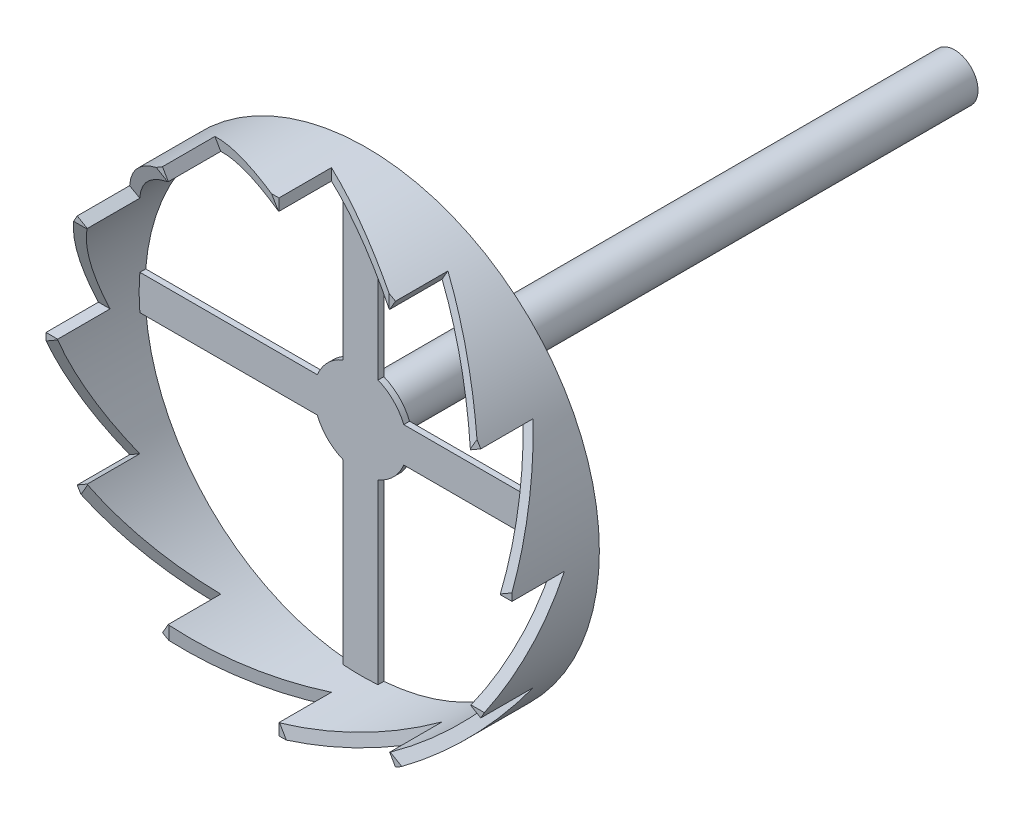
ISO-10303-21;
HEADER;
FILE_DESCRIPTION(('STEP AP214'),'2;1');
FILE_NAME('part.step','',(''),(''),'','','');
FILE_SCHEMA(('AUTOMOTIVE_DESIGN { 1 0 10303 214 1 1 1 1 }'));
ENDSEC;
DATA;
#1=APPLICATION_CONTEXT('core data for automotive mechanical design processes');
#2=APPLICATION_PROTOCOL_DEFINITION('international standard','automotive_design',2000,#1);
#3=PRODUCT_CONTEXT('',#1,'mechanical');
#4=PRODUCT('Part','Part','',(#3));
#5=PRODUCT_RELATED_PRODUCT_CATEGORY('part','',(#4));
#6=PRODUCT_DEFINITION_FORMATION('','',#4);
#7=PRODUCT_DEFINITION_CONTEXT('part definition',#1,'design');
#8=PRODUCT_DEFINITION('design','',#6,#7);
#9=PRODUCT_DEFINITION_SHAPE('','',#8);
#10=(LENGTH_UNIT() NAMED_UNIT(*) SI_UNIT(.MILLI.,.METRE.));
#11=(NAMED_UNIT(*) PLANE_ANGLE_UNIT() SI_UNIT($,.RADIAN.));
#12=(NAMED_UNIT(*) SI_UNIT($,.STERADIAN.) SOLID_ANGLE_UNIT());
#13=UNCERTAINTY_MEASURE_WITH_UNIT(LENGTH_MEASURE(1.E-05),#10,'distance_accuracy_value','');
#14=(GEOMETRIC_REPRESENTATION_CONTEXT(3) GLOBAL_UNCERTAINTY_ASSIGNED_CONTEXT((#13)) GLOBAL_UNIT_ASSIGNED_CONTEXT((#10,
#11,#12)) REPRESENTATION_CONTEXT('',''));
#15=CARTESIAN_POINT('',(0.,0.,0.));
#16=DIRECTION('',(0.,0.,1.));
#17=DIRECTION('',(1.,0.,0.));
#18=AXIS2_PLACEMENT_3D('',#15,#16,#17);
#19=CARTESIAN_POINT('',(0.,-99.,-4.));
#20=DIRECTION('',(0.,0.,1.));
#21=DIRECTION('',(1.,0.,0.));
#22=AXIS2_PLACEMENT_3D('',#19,#20,#21);
#23=PLANE('',#22);
#24=DIRECTION('',(0.866025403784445,0.499999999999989,0.));
#25=VECTOR('',#24,1.);
#26=CARTESIAN_POINT('',(-44.0913991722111,-102.63345645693,-3.99999999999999));
#27=LINE('',#26,#25);
#28=CARTESIAN_POINT('',(-39.9801554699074,-100.2598287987,-3.99999999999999));
#29=VERTEX_POINT('',#28);
#30=CARTESIAN_POINT('',(-37.9998214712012,-99.116482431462,-4.));
#31=VERTEX_POINT('',#30);
#32=EDGE_CURVE('E1173',#29,#31,#27,.T.);
#33=ORIENTED_EDGE('',*,*,#32,.T.);
#34=CARTESIAN_POINT('',(0.,-99.,-4.));
#35=DIRECTION('',(0.,0.,1.));
#36=DIRECTION('',(1.,0.,0.));
#37=AXIS2_PLACEMENT_3D('',#34,#35,#36);
#38=CIRCLE('',#37,38.);
#39=CARTESIAN_POINT('',(-38.,-99.,-3.99999999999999));
#40=VERTEX_POINT('',#39);
#41=EDGE_CURVE('E724',#40,#31,#38,.T.);
#42=ORIENTED_EDGE('',*,*,#41,.F.);
#43=DIRECTION('',(1.,0.,0.));
#44=VECTOR('',#43,1.);
#45=CARTESIAN_POINT('',(-40.001,-99.,-3.99999999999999));
#46=LINE('',#45,#44);
#47=CARTESIAN_POINT('',(-40.,-99.,-4.));
#48=VERTEX_POINT('',#47);
#49=EDGE_CURVE('E984',#48,#40,#46,.T.);
#50=ORIENTED_EDGE('',*,*,#49,.F.);
#51=CARTESIAN_POINT('',(0.,-99.,-4.));
#52=DIRECTION('',(0.,0.,1.));
#53=DIRECTION('',(1.,0.,0.));
#54=AXIS2_PLACEMENT_3D('',#51,#52,#53);
#55=CIRCLE('',#54,40.);
#56=EDGE_CURVE('E715',#48,#29,#55,.T.);
#57=ORIENTED_EDGE('',*,*,#56,.T.);
#58=EDGE_LOOP('',(#33,#42,#50,#57));
#59=FACE_BOUND('',#58,.T.);
#60=ADVANCED_FACE('F364',(#59),#23,.T.);
#61=DIRECTION('',(0.866025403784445,0.499999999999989,0.));
#62=VECTOR('',#61,1.);
#63=CARTESIAN_POINT('',(-34.6418821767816,-119.0005,-3.99999999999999));
#64=LINE('',#63,#62);
#65=CARTESIAN_POINT('',(-34.6410161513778,-119.,-4.));
#66=VERTEX_POINT('',#65);
#67=CARTESIAN_POINT('',(-32.9089653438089,-118.,-4.));
#68=VERTEX_POINT('',#67);
#69=EDGE_CURVE('E379',#66,#68,#64,.T.);
#70=ORIENTED_EDGE('',*,*,#69,.F.);
#71=CARTESIAN_POINT('',(-33.993915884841,-120.081121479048,-3.99999999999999));
#72=VERTEX_POINT('',#71);
#73=EDGE_CURVE('E705',#66,#72,#55,.T.);
#74=ORIENTED_EDGE('',*,*,#73,.T.);
#75=DIRECTION('',(0.50000000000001,0.866025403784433,0.));
#76=VECTOR('',#75,1.);
#77=CARTESIAN_POINT('',(-36.3675435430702,-124.192365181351,-3.99999999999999));
#78=LINE('',#77,#76);
#79=CARTESIAN_POINT('',(-32.8505695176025,-118.100787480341,-4.));
#80=VERTEX_POINT('',#79);
#81=EDGE_CURVE('E1159',#72,#80,#78,.T.);
#82=ORIENTED_EDGE('',*,*,#81,.T.);
#83=EDGE_CURVE('E707',#68,#80,#38,.T.);
#84=ORIENTED_EDGE('',*,*,#83,.F.);
#85=EDGE_LOOP('',(#70,#74,#82,#84));
#86=FACE_BOUND('',#85,.T.);
#87=ADVANCED_FACE('F703',(#86),#23,.T.);
#88=DIRECTION('',(0.50000000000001,0.866025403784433,0.));
#89=VECTOR('',#88,1.);
#90=CARTESIAN_POINT('',(-20.0005000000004,-133.641882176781,-3.99999999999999));
#91=LINE('',#90,#89);
#92=CARTESIAN_POINT('',(-20.0000000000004,-133.641016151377,-4.));
#93=VERTEX_POINT('',#92);
#94=CARTESIAN_POINT('',(-19.0000000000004,-131.908965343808,-4.));
#95=VERTEX_POINT('',#94);
#96=EDGE_CURVE('E387',#93,#95,#91,.T.);
#97=ORIENTED_EDGE('',*,*,#96,.F.);
#98=CARTESIAN_POINT('',(-18.8990339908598,-134.253744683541,-3.99999999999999));
#99=VERTEX_POINT('',#98);
#100=EDGE_CURVE('E716',#93,#99,#55,.T.);
#101=ORIENTED_EDGE('',*,*,#100,.T.);
#102=DIRECTION('',(0.,1.,0.));
#103=VECTOR('',#102,1.);
#104=CARTESIAN_POINT('',(-18.8990339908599,-139.001,-3.99999999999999));
#105=LINE('',#104,#103);
#106=CARTESIAN_POINT('',(-18.8990339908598,-131.967051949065,-4.));
#107=VERTEX_POINT('',#106);
#108=EDGE_CURVE('E1140',#99,#107,#105,.T.);
#109=ORIENTED_EDGE('',*,*,#108,.T.);
#110=EDGE_CURVE('E966',#95,#107,#38,.T.);
#111=ORIENTED_EDGE('',*,*,#110,.F.);
#112=EDGE_LOOP('',(#97,#101,#109,#111));
#113=FACE_BOUND('',#112,.T.);
#114=ADVANCED_FACE('F908',(#113),#23,.T.);
#115=DIRECTION('',(0.,1.,0.));
#116=VECTOR('',#115,1.);
#117=CARTESIAN_POINT('',(-4.16333634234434E-13,-139.001,-3.99999999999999));
#118=LINE('',#117,#116);
#119=CARTESIAN_POINT('',(-4.16333634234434E-13,-139.,-4.));
#120=VERTEX_POINT('',#119);
#121=CARTESIAN_POINT('',(-3.95374259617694E-13,-137.,-4.));
#122=VERTEX_POINT('',#121);
#123=EDGE_CURVE('E1155',#120,#122,#118,.T.);
#124=ORIENTED_EDGE('',*,*,#123,.F.);
#125=CARTESIAN_POINT('',(1.25982879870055,-138.980155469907,-3.99999999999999));
#126=VERTEX_POINT('',#125);
#127=EDGE_CURVE('E721',#120,#126,#55,.T.);
#128=ORIENTED_EDGE('',*,*,#127,.T.);
#129=DIRECTION('',(-0.499999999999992,0.866025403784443,0.));
#130=VECTOR('',#129,1.);
#131=CARTESIAN_POINT('',(3.6334564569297,-143.091399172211,-3.99999999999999));
#132=LINE('',#131,#130);
#133=CARTESIAN_POINT('',(0.116482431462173,-136.999821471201,-4.));
#134=VERTEX_POINT('',#133);
#135=EDGE_CURVE('E1121',#126,#134,#132,.T.);
#136=ORIENTED_EDGE('',*,*,#135,.T.);
#137=EDGE_CURVE('E1578',#122,#134,#38,.T.);
#138=ORIENTED_EDGE('',*,*,#137,.F.);
#139=EDGE_LOOP('',(#124,#128,#136,#138));
#140=FACE_BOUND('',#139,.T.);
#141=ADVANCED_FACE('F1493',(#140),#23,.T.);
#142=DIRECTION('',(-0.499999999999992,0.866025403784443,0.));
#143=VECTOR('',#142,1.);
#144=CARTESIAN_POINT('',(20.0004999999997,-133.641882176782,-3.99999999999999));
#145=LINE('',#144,#143);
#146=CARTESIAN_POINT('',(19.9999999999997,-133.641016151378,-4.));
#147=VERTEX_POINT('',#146);
#148=CARTESIAN_POINT('',(18.9999999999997,-131.908965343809,-4.));
#149=VERTEX_POINT('',#148);
#150=EDGE_CURVE('E1136',#147,#149,#145,.T.);
#151=ORIENTED_EDGE('',*,*,#150,.F.);
#152=CARTESIAN_POINT('',(21.0811214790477,-132.993915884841,-3.99999999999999));
#153=VERTEX_POINT('',#152);
#154=EDGE_CURVE('E1559',#147,#153,#55,.T.);
#155=ORIENTED_EDGE('',*,*,#154,.T.);
#156=DIRECTION('',(-0.866025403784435,0.500000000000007,0.));
#157=VECTOR('',#156,1.);
#158=CARTESIAN_POINT('',(25.1923651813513,-135.36754354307,-3.99999999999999));
#159=LINE('',#158,#157);
#160=CARTESIAN_POINT('',(19.1007874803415,-131.850569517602,-4.));
#161=VERTEX_POINT('',#160);
#162=EDGE_CURVE('E1102',#153,#161,#159,.T.);
#163=ORIENTED_EDGE('',*,*,#162,.T.);
#164=EDGE_CURVE('E1576',#149,#161,#38,.T.);
#165=ORIENTED_EDGE('',*,*,#164,.F.);
#166=EDGE_LOOP('',(#151,#155,#163,#165));
#167=FACE_BOUND('',#166,.T.);
#168=ADVANCED_FACE('F1500',(#167),#23,.T.);
#169=DIRECTION('',(-0.866025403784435,0.500000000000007,0.));
#170=VECTOR('',#169,1.);
#171=CARTESIAN_POINT('',(34.6418821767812,-119.0005,-3.99999999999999));
#172=LINE('',#171,#170);
#173=CARTESIAN_POINT('',(34.6410161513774,-119.,-4.));
#174=VERTEX_POINT('',#173);
#175=CARTESIAN_POINT('',(32.9089653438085,-118.,-4.));
#176=VERTEX_POINT('',#175);
#177=EDGE_CURVE('E1117',#174,#176,#172,.T.);
#178=ORIENTED_EDGE('',*,*,#177,.F.);
#179=CARTESIAN_POINT('',(35.2537446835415,-117.89903399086,-3.99999999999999));
#180=VERTEX_POINT('',#179);
#181=EDGE_CURVE('E1555',#174,#180,#55,.T.);
#182=ORIENTED_EDGE('',*,*,#181,.T.);
#183=DIRECTION('',(-1.,0.,0.));
#184=VECTOR('',#183,1.);
#185=CARTESIAN_POINT('',(40.0009999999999,-117.89903399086,-3.99999999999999));
#186=LINE('',#185,#184);
#187=CARTESIAN_POINT('',(32.9670519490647,-117.89903399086,-4.));
#188=VERTEX_POINT('',#187);
#189=EDGE_CURVE('E1083',#180,#188,#186,.T.);
#190=ORIENTED_EDGE('',*,*,#189,.T.);
#191=EDGE_CURVE('E1579',#176,#188,#38,.T.);
#192=ORIENTED_EDGE('',*,*,#191,.F.);
#193=EDGE_LOOP('',(#178,#182,#190,#192));
#194=FACE_BOUND('',#193,.T.);
#195=ADVANCED_FACE('F1507',(#194),#23,.T.);
#196=DIRECTION('',(-1.,0.,0.));
#197=VECTOR('',#196,1.);
#198=CARTESIAN_POINT('',(40.001,-99.0000000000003,-3.99999999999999));
#199=LINE('',#198,#197);
#200=CARTESIAN_POINT('',(40.,-99.0000000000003,-4.));
#201=VERTEX_POINT('',#200);
#202=CARTESIAN_POINT('',(38.,-99.0000000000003,-4.));
#203=VERTEX_POINT('',#202);
#204=EDGE_CURVE('E1098',#201,#203,#199,.T.);
#205=ORIENTED_EDGE('',*,*,#204,.F.);
#206=CARTESIAN_POINT('',(39.9801554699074,-97.7401712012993,-3.99999999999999));
#207=VERTEX_POINT('',#206);
#208=EDGE_CURVE('E1551',#201,#207,#55,.T.);
#209=ORIENTED_EDGE('',*,*,#208,.T.);
#210=DIRECTION('',(-0.866025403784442,-0.499999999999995,0.));
#211=VECTOR('',#210,1.);
#212=CARTESIAN_POINT('',(44.0913991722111,-95.3665435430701,-3.99999999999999));
#213=LINE('',#212,#211);
#214=CARTESIAN_POINT('',(37.9998214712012,-98.8835175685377,-4.));
#215=VERTEX_POINT('',#214);
#216=EDGE_CURVE('E1064',#207,#215,#213,.T.);
#217=ORIENTED_EDGE('',*,*,#216,.T.);
#218=EDGE_CURVE('E1580',#203,#215,#38,.T.);
#219=ORIENTED_EDGE('',*,*,#218,.F.);
#220=EDGE_LOOP('',(#205,#209,#217,#219));
#221=FACE_BOUND('',#220,.T.);
#222=ADVANCED_FACE('F1514',(#221),#23,.T.);
#223=DIRECTION('',(-0.866025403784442,-0.499999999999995,0.));
#224=VECTOR('',#223,1.);
#225=CARTESIAN_POINT('',(34.6418821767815,-78.9995000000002,-3.99999999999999));
#226=LINE('',#225,#224);
#227=CARTESIAN_POINT('',(34.6410161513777,-79.0000000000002,-4.));
#228=VERTEX_POINT('',#227);
#229=CARTESIAN_POINT('',(32.9089653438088,-80.0000000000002,-4.));
#230=VERTEX_POINT('',#229);
#231=EDGE_CURVE('E1079',#228,#230,#226,.T.);
#232=ORIENTED_EDGE('',*,*,#231,.F.);
#233=CARTESIAN_POINT('',(33.9939158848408,-77.9188785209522,-3.99999999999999));
#234=VERTEX_POINT('',#233);
#235=EDGE_CURVE('E1550',#228,#234,#55,.T.);
#236=ORIENTED_EDGE('',*,*,#235,.T.);
#237=DIRECTION('',(-0.500000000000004,-0.866025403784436,0.));
#238=VECTOR('',#237,1.);
#239=CARTESIAN_POINT('',(36.36754354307,-73.8076348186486,-3.99999999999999));
#240=LINE('',#239,#238);
#241=CARTESIAN_POINT('',(32.8505695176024,-79.8992125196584,-4.));
#242=VERTEX_POINT('',#241);
#243=EDGE_CURVE('E1045',#234,#242,#240,.T.);
#244=ORIENTED_EDGE('',*,*,#243,.T.);
#245=EDGE_CURVE('E1583',#230,#242,#38,.T.);
#246=ORIENTED_EDGE('',*,*,#245,.F.);
#247=EDGE_LOOP('',(#232,#236,#244,#246));
#248=FACE_BOUND('',#247,.T.);
#249=ADVANCED_FACE('F1521',(#248),#23,.T.);
#250=DIRECTION('',(-0.500000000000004,-0.866025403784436,0.));
#251=VECTOR('',#250,1.);
#252=CARTESIAN_POINT('',(20.0005000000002,-64.3581178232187,-3.99999999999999));
#253=LINE('',#252,#251);
#254=CARTESIAN_POINT('',(20.0000000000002,-64.3589838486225,-4.));
#255=VERTEX_POINT('',#254);
#256=CARTESIAN_POINT('',(19.0000000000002,-66.0910346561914,-4.));
#257=VERTEX_POINT('',#256);
#258=EDGE_CURVE('E1060',#255,#257,#253,.T.);
#259=ORIENTED_EDGE('',*,*,#258,.F.);
#260=CARTESIAN_POINT('',(18.8990339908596,-63.7462553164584,-3.99999999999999));
#261=VERTEX_POINT('',#260);
#262=EDGE_CURVE('E957',#255,#261,#55,.T.);
#263=ORIENTED_EDGE('',*,*,#262,.T.);
#264=DIRECTION('',(0.,-1.,0.));
#265=VECTOR('',#264,1.);
#266=CARTESIAN_POINT('',(18.8990339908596,-58.999,-3.99999999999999));
#267=LINE('',#266,#265);
#268=CARTESIAN_POINT('',(18.8990339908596,-66.0329480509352,-4.));
#269=VERTEX_POINT('',#268);
#270=EDGE_CURVE('E1024',#261,#269,#267,.T.);
#271=ORIENTED_EDGE('',*,*,#270,.T.);
#272=EDGE_CURVE('E1545',#257,#269,#38,.T.);
#273=ORIENTED_EDGE('',*,*,#272,.F.);
#274=EDGE_LOOP('',(#259,#263,#271,#273));
#275=FACE_BOUND('',#274,.T.);
#276=ADVANCED_FACE('F935',(#275),#23,.T.);
#277=DIRECTION('',(0.,-1.,0.));
#278=VECTOR('',#277,1.);
#279=CARTESIAN_POINT('',(1.38777878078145E-13,-58.999,-3.99999999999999));
#280=LINE('',#279,#278);
#281=CARTESIAN_POINT('',(1.38777878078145E-13,-59.,-4.));
#282=VERTEX_POINT('',#281);
#283=CARTESIAN_POINT('',(1.31791419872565E-13,-61.,-4.));
#284=VERTEX_POINT('',#283);
#285=EDGE_CURVE('E1040',#282,#284,#280,.T.);
#286=ORIENTED_EDGE('',*,*,#285,.F.);
#287=CARTESIAN_POINT('',(-1.25982879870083,-59.0198445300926,-3.99999999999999));
#288=VERTEX_POINT('',#287);
#289=EDGE_CURVE('E956',#282,#288,#55,.T.);
#290=ORIENTED_EDGE('',*,*,#289,.T.);
#291=DIRECTION('',(0.499999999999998,-0.86602540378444,0.));
#292=VECTOR('',#291,1.);
#293=CARTESIAN_POINT('',(-3.63345645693,-54.9086008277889,-3.99999999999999));
#294=LINE('',#293,#292);
#295=CARTESIAN_POINT('',(-0.11648243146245,-61.0001785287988,-4.));
#296=VERTEX_POINT('',#295);
#297=EDGE_CURVE('E1010',#288,#296,#294,.T.);
#298=ORIENTED_EDGE('',*,*,#297,.T.);
#299=EDGE_CURVE('E971',#284,#296,#38,.T.);
#300=ORIENTED_EDGE('',*,*,#299,.F.);
#301=EDGE_LOOP('',(#286,#290,#298,#300));
#302=FACE_BOUND('',#301,.T.);
#303=ADVANCED_FACE('F928',(#302),#23,.T.);
#304=DIRECTION('',(0.499999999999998,-0.86602540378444,0.));
#305=VECTOR('',#304,1.);
#306=CARTESIAN_POINT('',(-20.0004999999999,-64.3581178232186,-3.99999999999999));
#307=LINE('',#306,#305);
#308=CARTESIAN_POINT('',(-19.9999999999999,-64.3589838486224,-4.));
#309=VERTEX_POINT('',#308);
#310=CARTESIAN_POINT('',(-18.9999999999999,-66.0910346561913,-4.));
#311=VERTEX_POINT('',#310);
#312=EDGE_CURVE('E939',#309,#311,#307,.T.);
#313=ORIENTED_EDGE('',*,*,#312,.F.);
#314=CARTESIAN_POINT('',(-21.0811214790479,-65.0060841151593,-3.99999999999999));
#315=VERTEX_POINT('',#314);
#316=EDGE_CURVE('E942',#309,#315,#55,.T.);
#317=ORIENTED_EDGE('',*,*,#316,.T.);
#318=DIRECTION('',(0.866025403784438,-0.500000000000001,0.));
#319=VECTOR('',#318,1.);
#320=CARTESIAN_POINT('',(-25.1923651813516,-62.6324564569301,-3.99999999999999));
#321=LINE('',#320,#319);
#322=CARTESIAN_POINT('',(-19.1007874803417,-66.1494304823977,-4.));
#323=VERTEX_POINT('',#322);
#324=EDGE_CURVE('E995',#315,#323,#321,.T.);
#325=ORIENTED_EDGE('',*,*,#324,.T.);
#326=EDGE_CURVE('E944',#311,#323,#38,.T.);
#327=ORIENTED_EDGE('',*,*,#326,.F.);
#328=EDGE_LOOP('',(#313,#317,#325,#327));
#329=FACE_BOUND('',#328,.T.);
#330=ADVANCED_FACE('F915',(#329),#23,.T.);
#331=CARTESIAN_POINT('',(0.,-99.,-18.));
#332=DIRECTION('',(0.,0.,-1.));
#333=DIRECTION('',(-1.,0.,0.));
#334=AXIS2_PLACEMENT_3D('',#331,#332,#333);
#335=CYLINDRICAL_SURFACE('',#334,8.);
#336=CARTESIAN_POINT('',(0.,-99.,-19.));
#337=DIRECTION('',(0.,0.,1.));
#338=DIRECTION('',(1.,0.,0.));
#339=AXIS2_PLACEMENT_3D('',#336,#337,#338);
#340=CIRCLE('',#339,8.);
#341=CARTESIAN_POINT('',(7.41619848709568,-96.,-19.));
#342=VERTEX_POINT('',#341);
#343=CARTESIAN_POINT('',(3.00000000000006,-91.5838015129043,-19.));
#344=VERTEX_POINT('',#343);
#345=EDGE_CURVE('E751',#342,#344,#340,.T.);
#346=ORIENTED_EDGE('',*,*,#345,.T.);
#347=DIRECTION('',(0.,0.,-1.));
#348=VECTOR('',#347,1.);
#349=CARTESIAN_POINT('',(3.00000000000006,-91.5838015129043,-18.));
#350=LINE('',#349,#348);
#351=CARTESIAN_POINT('',(3.00000000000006,-91.5838015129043,-18.));
#352=VERTEX_POINT('',#351);
#353=EDGE_CURVE('E11',#352,#344,#350,.T.);
#354=ORIENTED_EDGE('',*,*,#353,.F.);
#355=CARTESIAN_POINT('',(0.,-99.,-18.));
#356=DIRECTION('',(0.,0.,1.));
#357=DIRECTION('',(1.,0.,0.));
#358=AXIS2_PLACEMENT_3D('',#355,#356,#357);
#359=CIRCLE('',#358,8.);
#360=CARTESIAN_POINT('',(7.41619848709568,-96.,-18.));
#361=VERTEX_POINT('',#360);
#362=EDGE_CURVE('E779',#361,#352,#359,.T.);
#363=ORIENTED_EDGE('',*,*,#362,.F.);
#364=DIRECTION('',(0.,0.,-1.));
#365=VECTOR('',#364,1.);
#366=CARTESIAN_POINT('',(7.41619848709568,-96.,-18.));
#367=LINE('',#366,#365);
#368=EDGE_CURVE('E804',#361,#342,#367,.T.);
#369=ORIENTED_EDGE('',*,*,#368,.T.);
#370=EDGE_LOOP('',(#346,#354,#363,#369));
#371=FACE_BOUND('',#370,.T.);
#372=ADVANCED_FACE('F366',(#371),#335,.T.);
#373=CARTESIAN_POINT('',(3.00000000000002,-59.1126586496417,-18.));
#374=DIRECTION('',(-1.,0.,0.));
#375=DIRECTION('',(0.,-1.,0.));
#376=AXIS2_PLACEMENT_3D('',#373,#374,#375);
#377=PLANE('',#376);
#378=DIRECTION('',(0.,1.,0.));
#379=VECTOR('',#378,1.);
#380=CARTESIAN_POINT('',(3.00000000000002,-59.1126586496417,-19.));
#381=LINE('',#380,#379);
#382=CARTESIAN_POINT('',(3.00000000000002,-61.1186061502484,-19.));
#383=VERTEX_POINT('',#382);
#384=EDGE_CURVE('E754',#344,#383,#381,.T.);
#385=ORIENTED_EDGE('',*,*,#384,.T.);
#386=DIRECTION('',(0.,0.,-1.));
#387=VECTOR('',#386,1.);
#388=CARTESIAN_POINT('',(3.00000000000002,-61.1186061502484,-4.));
#389=LINE('',#388,#387);
#390=CARTESIAN_POINT('',(3.00000000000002,-61.1186061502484,-18.));
#391=VERTEX_POINT('',#390);
#392=EDGE_CURVE('E737',#383,#391,#389,.F.);
#393=ORIENTED_EDGE('',*,*,#392,.T.);
#394=DIRECTION('',(0.,1.,0.));
#395=VECTOR('',#394,1.);
#396=CARTESIAN_POINT('',(3.00000000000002,-59.1126586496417,-18.));
#397=LINE('',#396,#395);
#398=EDGE_CURVE('E782',#352,#391,#397,.T.);
#399=ORIENTED_EDGE('',*,*,#398,.F.);
#400=ORIENTED_EDGE('',*,*,#353,.T.);
#401=EDGE_LOOP('',(#385,#393,#399,#400));
#402=FACE_BOUND('',#401,.T.);
#403=ADVANCED_FACE('F890',(#402),#377,.F.);
#404=CARTESIAN_POINT('',(-2.99999999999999,-91.5838015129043,-18.));
#405=DIRECTION('',(1.,0.,0.));
#406=DIRECTION('',(0.,0.,-1.));
#407=AXIS2_PLACEMENT_3D('',#404,#405,#406);
#408=PLANE('',#407);
#409=DIRECTION('',(0.,-1.,0.));
#410=VECTOR('',#409,1.);
#411=CARTESIAN_POINT('',(-2.99999999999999,-91.5838015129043,-18.));
#412=LINE('',#411,#410);
#413=CARTESIAN_POINT('',(-2.99999999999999,-61.1186061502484,-18.));
#414=VERTEX_POINT('',#413);
#415=CARTESIAN_POINT('',(-2.99999999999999,-91.5838015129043,-18.));
#416=VERTEX_POINT('',#415);
#417=EDGE_CURVE('E784',#414,#416,#412,.T.);
#418=ORIENTED_EDGE('',*,*,#417,.F.);
#419=DIRECTION('',(0.,0.,-1.));
#420=VECTOR('',#419,1.);
#421=CARTESIAN_POINT('',(-2.99999999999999,-61.1186061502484,-4.));
#422=LINE('',#421,#420);
#423=CARTESIAN_POINT('',(-2.99999999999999,-61.1186061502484,-19.));
#424=VERTEX_POINT('',#423);
#425=EDGE_CURVE('E735',#414,#424,#422,.T.);
#426=ORIENTED_EDGE('',*,*,#425,.T.);
#427=DIRECTION('',(0.,-1.,0.));
#428=VECTOR('',#427,1.);
#429=CARTESIAN_POINT('',(-2.99999999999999,-91.5838015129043,-19.));
#430=LINE('',#429,#428);
#431=CARTESIAN_POINT('',(-2.99999999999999,-91.5838015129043,-19.));
#432=VERTEX_POINT('',#431);
#433=EDGE_CURVE('E756',#424,#432,#430,.T.);
#434=ORIENTED_EDGE('',*,*,#433,.T.);
#435=DIRECTION('',(0.,0.,-1.));
#436=VECTOR('',#435,1.);
#437=CARTESIAN_POINT('',(-2.99999999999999,-91.5838015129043,-18.));
#438=LINE('',#437,#436);
#439=EDGE_CURVE('E372',#416,#432,#438,.T.);
#440=ORIENTED_EDGE('',*,*,#439,.F.);
#441=EDGE_LOOP('',(#418,#426,#434,#440));
#442=FACE_BOUND('',#441,.T.);
#443=ADVANCED_FACE('F891',(#442),#408,.F.);
#444=CARTESIAN_POINT('',(0.,-99.,-18.));
#445=DIRECTION('',(0.,0.,-1.));
#446=DIRECTION('',(-1.,0.,0.));
#447=AXIS2_PLACEMENT_3D('',#444,#445,#446);
#448=CYLINDRICAL_SURFACE('',#447,8.);
#449=CARTESIAN_POINT('',(0.,-99.,-19.));
#450=DIRECTION('',(0.,0.,1.));
#451=DIRECTION('',(1.,0.,0.));
#452=AXIS2_PLACEMENT_3D('',#449,#450,#451);
#453=CIRCLE('',#452,8.);
#454=CARTESIAN_POINT('',(-7.41619848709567,-96.,-19.));
#455=VERTEX_POINT('',#454);
#456=EDGE_CURVE('E758',#432,#455,#453,.T.);
#457=ORIENTED_EDGE('',*,*,#456,.T.);
#458=DIRECTION('',(0.,0.,-1.));
#459=VECTOR('',#458,1.);
#460=CARTESIAN_POINT('',(-7.41619848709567,-96.,-18.));
#461=LINE('',#460,#459);
#462=CARTESIAN_POINT('',(-7.41619848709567,-96.,-18.));
#463=VERTEX_POINT('',#462);
#464=EDGE_CURVE('E819',#463,#455,#461,.T.);
#465=ORIENTED_EDGE('',*,*,#464,.F.);
#466=CARTESIAN_POINT('',(0.,-99.,-18.));
#467=DIRECTION('',(0.,0.,1.));
#468=DIRECTION('',(1.,0.,0.));
#469=AXIS2_PLACEMENT_3D('',#466,#467,#468);
#470=CIRCLE('',#469,8.);
#471=EDGE_CURVE('E786',#416,#463,#470,.T.);
#472=ORIENTED_EDGE('',*,*,#471,.F.);
#473=ORIENTED_EDGE('',*,*,#439,.T.);
#474=EDGE_LOOP('',(#457,#465,#472,#473));
#475=FACE_BOUND('',#474,.T.);
#476=ADVANCED_FACE('F826',(#475),#448,.T.);
#477=CARTESIAN_POINT('',(-7.41619848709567,-96.,-18.));
#478=DIRECTION('',(0.,-1.,0.));
#479=DIRECTION('',(0.,0.,-1.));
#480=AXIS2_PLACEMENT_3D('',#477,#478,#479);
#481=PLANE('',#480);
#482=DIRECTION('',(-1.,0.,0.));
#483=VECTOR('',#482,1.);
#484=CARTESIAN_POINT('',(-7.41619848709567,-96.,-19.));
#485=LINE('',#484,#483);
#486=CARTESIAN_POINT('',(-37.8813938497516,-96.,-19.));
#487=VERTEX_POINT('',#486);
#488=EDGE_CURVE('E760',#455,#487,#485,.T.);
#489=ORIENTED_EDGE('',*,*,#488,.T.);
#490=DIRECTION('',(0.,0.,-1.));
#491=VECTOR('',#490,1.);
#492=CARTESIAN_POINT('',(-37.8813938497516,-96.,-4.));
#493=LINE('',#492,#491);
#494=CARTESIAN_POINT('',(-37.8813938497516,-96.,-18.));
#495=VERTEX_POINT('',#494);
#496=EDGE_CURVE('E743',#487,#495,#493,.F.);
#497=ORIENTED_EDGE('',*,*,#496,.T.);
#498=DIRECTION('',(-1.,0.,0.));
#499=VECTOR('',#498,1.);
#500=CARTESIAN_POINT('',(-7.41619848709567,-96.,-18.));
#501=LINE('',#500,#499);
#502=EDGE_CURVE('E788',#463,#495,#501,.T.);
#503=ORIENTED_EDGE('',*,*,#502,.F.);
#504=ORIENTED_EDGE('',*,*,#464,.T.);
#505=EDGE_LOOP('',(#489,#497,#503,#504));
#506=FACE_BOUND('',#505,.T.);
#507=ADVANCED_FACE('F840',(#506),#481,.F.);
#508=CARTESIAN_POINT('',(-39.8873413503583,-102.,-18.));
#509=DIRECTION('',(0.,1.,0.));
#510=DIRECTION('',(-1.,0.,0.));
#511=AXIS2_PLACEMENT_3D('',#508,#509,#510);
#512=PLANE('',#511);
#513=DIRECTION('',(1.,0.,0.));
#514=VECTOR('',#513,1.);
#515=CARTESIAN_POINT('',(-39.8873413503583,-102.,-18.));
#516=LINE('',#515,#514);
#517=CARTESIAN_POINT('',(-37.8813938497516,-102.,-18.));
#518=VERTEX_POINT('',#517);
#519=CARTESIAN_POINT('',(-7.41619848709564,-102.,-18.));
#520=VERTEX_POINT('',#519);
#521=EDGE_CURVE('E790',#518,#520,#516,.T.);
#522=ORIENTED_EDGE('',*,*,#521,.F.);
#523=DIRECTION('',(0.,0.,-1.));
#524=VECTOR('',#523,1.);
#525=CARTESIAN_POINT('',(-37.8813938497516,-102.,-4.));
#526=LINE('',#525,#524);
#527=CARTESIAN_POINT('',(-37.8813938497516,-102.,-19.));
#528=VERTEX_POINT('',#527);
#529=EDGE_CURVE('E741',#518,#528,#526,.T.);
#530=ORIENTED_EDGE('',*,*,#529,.T.);
#531=DIRECTION('',(1.,0.,0.));
#532=VECTOR('',#531,1.);
#533=CARTESIAN_POINT('',(-39.8873413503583,-102.,-19.));
#534=LINE('',#533,#532);
#535=CARTESIAN_POINT('',(-7.41619848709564,-102.,-19.));
#536=VERTEX_POINT('',#535);
#537=EDGE_CURVE('E762',#528,#536,#534,.T.);
#538=ORIENTED_EDGE('',*,*,#537,.T.);
#539=DIRECTION('',(0.,0.,-1.));
#540=VECTOR('',#539,1.);
#541=CARTESIAN_POINT('',(-7.41619848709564,-102.,-18.));
#542=LINE('',#541,#540);
#543=EDGE_CURVE('E816',#520,#536,#542,.T.);
#544=ORIENTED_EDGE('',*,*,#543,.F.);
#545=EDGE_LOOP('',(#522,#530,#538,#544));
#546=FACE_BOUND('',#545,.T.);
#547=ADVANCED_FACE('F1335',(#546),#512,.F.);
#548=CARTESIAN_POINT('',(0.,-99.,-18.));
#549=DIRECTION('',(0.,0.,-1.));
#550=DIRECTION('',(-1.,0.,0.));
#551=AXIS2_PLACEMENT_3D('',#548,#549,#550);
#552=CYLINDRICAL_SURFACE('',#551,8.);
#553=CARTESIAN_POINT('',(0.,-99.,-19.));
#554=DIRECTION('',(0.,0.,1.));
#555=DIRECTION('',(1.,0.,0.));
#556=AXIS2_PLACEMENT_3D('',#553,#554,#555);
#557=CIRCLE('',#556,8.);
#558=CARTESIAN_POINT('',(-2.99999999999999,-106.416198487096,-19.));
#559=VERTEX_POINT('',#558);
#560=EDGE_CURVE('E764',#536,#559,#557,.T.);
#561=ORIENTED_EDGE('',*,*,#560,.T.);
#562=DIRECTION('',(0.,0.,-1.));
#563=VECTOR('',#562,1.);
#564=CARTESIAN_POINT('',(-2.99999999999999,-106.416198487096,-18.));
#565=LINE('',#564,#563);
#566=CARTESIAN_POINT('',(-2.99999999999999,-106.416198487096,-18.));
#567=VERTEX_POINT('',#566);
#568=EDGE_CURVE('E813',#567,#559,#565,.T.);
#569=ORIENTED_EDGE('',*,*,#568,.F.);
#570=CARTESIAN_POINT('',(0.,-99.,-18.));
#571=DIRECTION('',(0.,0.,1.));
#572=DIRECTION('',(1.,0.,0.));
#573=AXIS2_PLACEMENT_3D('',#570,#571,#572);
#574=CIRCLE('',#573,8.);
#575=EDGE_CURVE('E792',#520,#567,#574,.T.);
#576=ORIENTED_EDGE('',*,*,#575,.F.);
#577=ORIENTED_EDGE('',*,*,#543,.T.);
#578=EDGE_LOOP('',(#561,#569,#576,#577));
#579=FACE_BOUND('',#578,.T.);
#580=ADVANCED_FACE('F1329',(#579),#552,.T.);
#581=CARTESIAN_POINT('',(-2.99999999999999,-106.416198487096,-18.));
#582=DIRECTION('',(1.,0.,0.));
#583=DIRECTION('',(0.,0.,-1.));
#584=AXIS2_PLACEMENT_3D('',#581,#582,#583);
#585=PLANE('',#584);
#586=DIRECTION('',(0.,-1.,0.));
#587=VECTOR('',#586,1.);
#588=CARTESIAN_POINT('',(-2.99999999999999,-106.416198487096,-19.));
#589=LINE('',#588,#587);
#590=CARTESIAN_POINT('',(-2.99999999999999,-136.881393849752,-19.));
#591=VERTEX_POINT('',#590);
#592=EDGE_CURVE('E766',#559,#591,#589,.T.);
#593=ORIENTED_EDGE('',*,*,#592,.T.);
#594=DIRECTION('',(0.,0.,-1.));
#595=VECTOR('',#594,1.);
#596=CARTESIAN_POINT('',(-2.99999999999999,-136.881393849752,-4.));
#597=LINE('',#596,#595);
#598=CARTESIAN_POINT('',(-2.99999999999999,-136.881393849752,-18.));
#599=VERTEX_POINT('',#598);
#600=EDGE_CURVE('E748',#591,#599,#597,.F.);
#601=ORIENTED_EDGE('',*,*,#600,.T.);
#602=DIRECTION('',(0.,-1.,0.));
#603=VECTOR('',#602,1.);
#604=CARTESIAN_POINT('',(-2.99999999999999,-106.416198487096,-18.));
#605=LINE('',#604,#603);
#606=EDGE_CURVE('E794',#567,#599,#605,.T.);
#607=ORIENTED_EDGE('',*,*,#606,.F.);
#608=ORIENTED_EDGE('',*,*,#568,.T.);
#609=EDGE_LOOP('',(#593,#601,#607,#608));
#610=FACE_BOUND('',#609,.T.);
#611=ADVANCED_FACE('F1322',(#610),#585,.F.);
#612=CARTESIAN_POINT('',(2.99999999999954,-138.887341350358,-18.));
#613=DIRECTION('',(-1.,0.,0.));
#614=DIRECTION('',(0.,-1.,0.));
#615=AXIS2_PLACEMENT_3D('',#612,#613,#614);
#616=PLANE('',#615);
#617=DIRECTION('',(0.,1.,0.));
#618=VECTOR('',#617,1.);
#619=CARTESIAN_POINT('',(2.99999999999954,-138.887341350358,-18.));
#620=LINE('',#619,#618);
#621=CARTESIAN_POINT('',(2.99999999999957,-136.881393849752,-18.));
#622=VERTEX_POINT('',#621);
#623=CARTESIAN_POINT('',(2.99999999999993,-106.416198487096,-18.));
#624=VERTEX_POINT('',#623);
#625=EDGE_CURVE('E796',#622,#624,#620,.T.);
#626=ORIENTED_EDGE('',*,*,#625,.F.);
#627=DIRECTION('',(0.,0.,-1.));
#628=VECTOR('',#627,1.);
#629=CARTESIAN_POINT('',(2.99999999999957,-136.881393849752,-4.));
#630=LINE('',#629,#628);
#631=CARTESIAN_POINT('',(2.99999999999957,-136.881393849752,-19.));
#632=VERTEX_POINT('',#631);
#633=EDGE_CURVE('E746',#622,#632,#630,.T.);
#634=ORIENTED_EDGE('',*,*,#633,.T.);
#635=DIRECTION('',(0.,1.,0.));
#636=VECTOR('',#635,1.);
#637=CARTESIAN_POINT('',(2.99999999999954,-138.887341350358,-19.));
#638=LINE('',#637,#636);
#639=CARTESIAN_POINT('',(2.99999999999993,-106.416198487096,-19.));
#640=VERTEX_POINT('',#639);
#641=EDGE_CURVE('E768',#632,#640,#638,.T.);
#642=ORIENTED_EDGE('',*,*,#641,.T.);
#643=DIRECTION('',(0.,0.,-1.));
#644=VECTOR('',#643,1.);
#645=CARTESIAN_POINT('',(2.99999999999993,-106.416198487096,-18.));
#646=LINE('',#645,#644);
#647=EDGE_CURVE('E810',#624,#640,#646,.T.);
#648=ORIENTED_EDGE('',*,*,#647,.F.);
#649=EDGE_LOOP('',(#626,#634,#642,#648));
#650=FACE_BOUND('',#649,.T.);
#651=ADVANCED_FACE('F861',(#650),#616,.F.);
#652=CARTESIAN_POINT('',(0.,-99.,-18.));
#653=DIRECTION('',(0.,0.,-1.));
#654=DIRECTION('',(-1.,0.,0.));
#655=AXIS2_PLACEMENT_3D('',#652,#653,#654);
#656=CYLINDRICAL_SURFACE('',#655,8.00000000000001);
#657=CARTESIAN_POINT('',(0.,-99.,-19.));
#658=DIRECTION('',(0.,0.,1.));
#659=DIRECTION('',(1.,0.,0.));
#660=AXIS2_PLACEMENT_3D('',#657,#658,#659);
#661=CIRCLE('',#660,8.00000000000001);
#662=CARTESIAN_POINT('',(7.41619848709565,-102.,-19.));
#663=VERTEX_POINT('',#662);
#664=EDGE_CURVE('E770',#640,#663,#661,.T.);
#665=ORIENTED_EDGE('',*,*,#664,.T.);
#666=DIRECTION('',(0.,0.,-1.));
#667=VECTOR('',#666,1.);
#668=CARTESIAN_POINT('',(7.41619848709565,-102.,-18.));
#669=LINE('',#668,#667);
#670=CARTESIAN_POINT('',(7.41619848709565,-102.,-18.));
#671=VERTEX_POINT('',#670);
#672=EDGE_CURVE('E807',#671,#663,#669,.T.);
#673=ORIENTED_EDGE('',*,*,#672,.F.);
#674=CARTESIAN_POINT('',(0.,-99.,-18.));
#675=DIRECTION('',(0.,0.,1.));
#676=DIRECTION('',(1.,0.,0.));
#677=AXIS2_PLACEMENT_3D('',#674,#675,#676);
#678=CIRCLE('',#677,8.00000000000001);
#679=EDGE_CURVE('E798',#624,#671,#678,.T.);
#680=ORIENTED_EDGE('',*,*,#679,.F.);
#681=ORIENTED_EDGE('',*,*,#647,.T.);
#682=EDGE_LOOP('',(#665,#673,#680,#681));
#683=FACE_BOUND('',#682,.T.);
#684=ADVANCED_FACE('F867',(#683),#656,.T.);
#685=CARTESIAN_POINT('',(39.8873413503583,-102.,-18.));
#686=DIRECTION('',(0.,1.,0.));
#687=DIRECTION('',(-1.,0.,0.));
#688=AXIS2_PLACEMENT_3D('',#685,#686,#687);
#689=PLANE('',#688);
#690=DIRECTION('',(1.,0.,0.));
#691=VECTOR('',#690,1.);
#692=CARTESIAN_POINT('',(39.8873413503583,-102.,-19.));
#693=LINE('',#692,#691);
#694=CARTESIAN_POINT('',(37.8813938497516,-102.,-19.));
#695=VERTEX_POINT('',#694);
#696=EDGE_CURVE('E772',#663,#695,#693,.T.);
#697=ORIENTED_EDGE('',*,*,#696,.T.);
#698=DIRECTION('',(0.,0.,-1.));
#699=VECTOR('',#698,1.);
#700=CARTESIAN_POINT('',(37.8813938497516,-102.,-4.));
#701=LINE('',#700,#699);
#702=CARTESIAN_POINT('',(37.8813938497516,-102.,-18.));
#703=VERTEX_POINT('',#702);
#704=EDGE_CURVE('E732',#695,#703,#701,.F.);
#705=ORIENTED_EDGE('',*,*,#704,.T.);
#706=DIRECTION('',(1.,0.,0.));
#707=VECTOR('',#706,1.);
#708=CARTESIAN_POINT('',(39.8873413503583,-102.,-18.));
#709=LINE('',#708,#707);
#710=EDGE_CURVE('E800',#671,#703,#709,.T.);
#711=ORIENTED_EDGE('',*,*,#710,.F.);
#712=ORIENTED_EDGE('',*,*,#672,.T.);
#713=EDGE_LOOP('',(#697,#705,#711,#712));
#714=FACE_BOUND('',#713,.T.);
#715=ADVANCED_FACE('F872',(#714),#689,.F.);
#716=CARTESIAN_POINT('',(0.,-99.,-18.));
#717=DIRECTION('',(0.,0.,-1.));
#718=DIRECTION('',(-1.,0.,0.));
#719=AXIS2_PLACEMENT_3D('',#716,#717,#718);
#720=CYLINDRICAL_SURFACE('',#719,40.);
#721=CARTESIAN_POINT('',(0.,-99.,-19.));
#722=DIRECTION('',(0.,0.,1.));
#723=DIRECTION('',(1.,0.,0.));
#724=AXIS2_PLACEMENT_3D('',#721,#722,#723);
#725=CIRCLE('',#724,40.);
#726=CARTESIAN_POINT('',(40.,-99.,-19.));
#727=VERTEX_POINT('',#726);
#728=EDGE_CURVE('E774',#727,#727,#725,.T.);
#729=ORIENTED_EDGE('',*,*,#728,.T.);
#730=EDGE_LOOP('',(#729));
#731=FACE_BOUND('',#730,.T.);
#732=DIRECTION('',(0.,0.,-1.));
#733=VECTOR('',#732,1.);
#734=CARTESIAN_POINT('',(-34.6410161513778,-119.,-18.));
#735=LINE('',#734,#733);
#736=CARTESIAN_POINT('',(-34.6410161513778,-119.,-13.));
#737=VERTEX_POINT('',#736);
#738=EDGE_CURVE('E691',#737,#66,#735,.F.);
#739=ORIENTED_EDGE('',*,*,#738,.F.);
#740=CARTESIAN_POINT('',(0.,-99.,-13.));
#741=DIRECTION('',(-0.214975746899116,0.372348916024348,-0.902851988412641));
#742=DIRECTION('',(0.451425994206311,-0.781892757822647,-0.429951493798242));
#743=AXIS2_PLACEMENT_3D('',#740,#741,#742);
#744=ELLIPSE('',#743,44.3040504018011,40.);
#745=EDGE_CURVE('E1177',#29,#737,#744,.F.);
#746=ORIENTED_EDGE('',*,*,#745,.F.);
#747=ORIENTED_EDGE('',*,*,#56,.F.);
#748=DIRECTION('',(0.,0.,-1.));
#749=VECTOR('',#748,1.);
#750=CARTESIAN_POINT('',(-40.,-99.,-18.));
#751=LINE('',#750,#749);
#752=CARTESIAN_POINT('',(-40.,-99.,-13.));
#753=VERTEX_POINT('',#752);
#754=EDGE_CURVE('E975',#753,#48,#751,.F.);
#755=ORIENTED_EDGE('',*,*,#754,.F.);
#756=CARTESIAN_POINT('',(0.,-99.,-13.));
#757=DIRECTION('',(0.,0.429951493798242,-0.902851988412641));
#758=DIRECTION('',(0.,-0.902851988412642,-0.429951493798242));
#759=AXIS2_PLACEMENT_3D('',#756,#757,#758);
#760=ELLIPSE('',#759,44.3040504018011,40.);
#761=CARTESIAN_POINT('',(-35.2537446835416,-80.1009660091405,-3.99999999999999));
#762=VERTEX_POINT('',#761);
#763=EDGE_CURVE('E987',#762,#753,#760,.F.);
#764=ORIENTED_EDGE('',*,*,#763,.F.);
#765=CARTESIAN_POINT('',(-34.6410161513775,-78.9999999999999,-4.));
#766=VERTEX_POINT('',#765);
#767=EDGE_CURVE('E720',#766,#762,#55,.T.);
#768=ORIENTED_EDGE('',*,*,#767,.F.);
#769=DIRECTION('',(0.,0.,-1.));
#770=VECTOR('',#769,1.);
#771=CARTESIAN_POINT('',(-34.6410161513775,-78.9999999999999,-18.));
#772=LINE('',#771,#770);
#773=CARTESIAN_POINT('',(-34.6410161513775,-78.9999999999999,-13.));
#774=VERTEX_POINT('',#773);
#775=EDGE_CURVE('E1008',#774,#766,#772,.F.);
#776=ORIENTED_EDGE('',*,*,#775,.F.);
#777=CARTESIAN_POINT('',(0.,-99.,-13.));
#778=DIRECTION('',(0.214975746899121,0.372348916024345,-0.902851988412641));
#779=DIRECTION('',(-0.451425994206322,-0.781892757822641,-0.429951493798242));
#780=AXIS2_PLACEMENT_3D('',#777,#778,#779);
#781=ELLIPSE('',#780,44.3040504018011,40.);
#782=EDGE_CURVE('E955',#315,#774,#781,.F.);
#783=ORIENTED_EDGE('',*,*,#782,.F.);
#784=ORIENTED_EDGE('',*,*,#316,.F.);
#785=DIRECTION('',(0.,0.,-1.));
#786=VECTOR('',#785,1.);
#787=CARTESIAN_POINT('',(-19.9999999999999,-64.3589838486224,-18.));
#788=LINE('',#787,#786);
#789=CARTESIAN_POINT('',(-19.9999999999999,-64.3589838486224,-13.));
#790=VERTEX_POINT('',#789);
#791=EDGE_CURVE('E948',#790,#309,#788,.F.);
#792=ORIENTED_EDGE('',*,*,#791,.F.);
#793=CARTESIAN_POINT('',(0.,-99.,-13.));
#794=DIRECTION('',(0.372348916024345,0.21497574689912,-0.902851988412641));
#795=DIRECTION('',(-0.781892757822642,-0.451425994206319,-0.429951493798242));
#796=AXIS2_PLACEMENT_3D('',#793,#794,#795);
#797=ELLIPSE('',#796,44.3040504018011,40.);
#798=EDGE_CURVE('E1016',#288,#790,#797,.F.);
#799=ORIENTED_EDGE('',*,*,#798,.F.);
#800=ORIENTED_EDGE('',*,*,#289,.F.);
#801=DIRECTION('',(0.,0.,-1.));
#802=VECTOR('',#801,1.);
#803=CARTESIAN_POINT('',(1.38777878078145E-13,-59.,-18.));
#804=LINE('',#803,#802);
#805=CARTESIAN_POINT('',(1.38777878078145E-13,-59.,-13.));
#806=VERTEX_POINT('',#805);
#807=EDGE_CURVE('E1042',#806,#282,#804,.F.);
#808=ORIENTED_EDGE('',*,*,#807,.F.);
#809=CARTESIAN_POINT('',(0.,-99.,-13.));
#810=DIRECTION('',(0.429951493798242,0.,-0.902851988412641));
#811=DIRECTION('',(-0.902851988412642,0.,-0.429951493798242));
#812=AXIS2_PLACEMENT_3D('',#809,#810,#811);
#813=ELLIPSE('',#812,44.3040504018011,40.);
#814=EDGE_CURVE('E1030',#261,#806,#813,.F.);
#815=ORIENTED_EDGE('',*,*,#814,.F.);
#816=ORIENTED_EDGE('',*,*,#262,.F.);
#817=DIRECTION('',(0.,0.,-1.));
#818=VECTOR('',#817,1.);
#819=CARTESIAN_POINT('',(20.0000000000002,-64.3589838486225,-18.));
#820=LINE('',#819,#818);
#821=CARTESIAN_POINT('',(20.0000000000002,-64.3589838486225,-13.));
#822=VERTEX_POINT('',#821);
#823=EDGE_CURVE('E1062',#822,#255,#820,.F.);
#824=ORIENTED_EDGE('',*,*,#823,.F.);
#825=CARTESIAN_POINT('',(0.,-99.,-13.));
#826=DIRECTION('',(0.372348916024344,-0.214975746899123,-0.902851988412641));
#827=DIRECTION('',(-0.781892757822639,0.451425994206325,-0.429951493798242));
#828=AXIS2_PLACEMENT_3D('',#825,#826,#827);
#829=ELLIPSE('',#828,44.3040504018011,40.);
#830=EDGE_CURVE('E1051',#234,#822,#829,.F.);
#831=ORIENTED_EDGE('',*,*,#830,.F.);
#832=ORIENTED_EDGE('',*,*,#235,.F.);
#833=DIRECTION('',(0.,0.,-1.));
#834=VECTOR('',#833,1.);
#835=CARTESIAN_POINT('',(34.6410161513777,-79.0000000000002,-18.));
#836=LINE('',#835,#834);
#837=CARTESIAN_POINT('',(34.6410161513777,-79.0000000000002,-13.));
#838=VERTEX_POINT('',#837);
#839=EDGE_CURVE('E1081',#838,#228,#836,.F.);
#840=ORIENTED_EDGE('',*,*,#839,.F.);
#841=CARTESIAN_POINT('',(0.,-99.,-13.));
#842=DIRECTION('',(0.214975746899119,-0.372348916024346,-0.902851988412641));
#843=DIRECTION('',(-0.451425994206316,0.781892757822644,-0.429951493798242));
#844=AXIS2_PLACEMENT_3D('',#841,#842,#843);
#845=ELLIPSE('',#844,44.3040504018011,40.);
#846=EDGE_CURVE('E1070',#207,#838,#845,.F.);
#847=ORIENTED_EDGE('',*,*,#846,.F.);
#848=ORIENTED_EDGE('',*,*,#208,.F.);
#849=DIRECTION('',(0.,0.,-1.));
#850=VECTOR('',#849,1.);
#851=CARTESIAN_POINT('',(40.,-99.0000000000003,-18.));
#852=LINE('',#851,#850);
#853=CARTESIAN_POINT('',(40.,-99.0000000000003,-13.));
#854=VERTEX_POINT('',#853);
#855=EDGE_CURVE('E1100',#854,#201,#852,.F.);
#856=ORIENTED_EDGE('',*,*,#855,.F.);
#857=CARTESIAN_POINT('',(0.,-99.,-13.));
#858=DIRECTION('',(0.,-0.429951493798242,-0.902851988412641));
#859=DIRECTION('',(0.,0.902851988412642,-0.429951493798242));
#860=AXIS2_PLACEMENT_3D('',#857,#858,#859);
#861=ELLIPSE('',#860,44.3040504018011,40.);
#862=EDGE_CURVE('E1089',#180,#854,#861,.F.);
#863=ORIENTED_EDGE('',*,*,#862,.F.);
#864=ORIENTED_EDGE('',*,*,#181,.F.);
#865=DIRECTION('',(0.,0.,-1.));
#866=VECTOR('',#865,1.);
#867=CARTESIAN_POINT('',(34.6410161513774,-119.,-18.));
#868=LINE('',#867,#866);
#869=CARTESIAN_POINT('',(34.6410161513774,-119.,-13.));
#870=VERTEX_POINT('',#869);
#871=EDGE_CURVE('E1119',#870,#174,#868,.F.);
#872=ORIENTED_EDGE('',*,*,#871,.F.);
#873=CARTESIAN_POINT('',(0.,-99.,-13.));
#874=DIRECTION('',(-0.214975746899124,-0.372348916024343,-0.902851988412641));
#875=DIRECTION('',(0.451425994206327,0.781892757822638,-0.429951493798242));
#876=AXIS2_PLACEMENT_3D('',#873,#874,#875);
#877=ELLIPSE('',#876,44.3040504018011,40.);
#878=EDGE_CURVE('E1108',#153,#870,#877,.F.);
#879=ORIENTED_EDGE('',*,*,#878,.F.);
#880=ORIENTED_EDGE('',*,*,#154,.F.);
#881=DIRECTION('',(0.,0.,-1.));
#882=VECTOR('',#881,1.);
#883=CARTESIAN_POINT('',(19.9999999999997,-133.641016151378,-18.));
#884=LINE('',#883,#882);
#885=CARTESIAN_POINT('',(19.9999999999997,-133.641016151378,-13.));
#886=VERTEX_POINT('',#885);
#887=EDGE_CURVE('E1138',#886,#147,#884,.F.);
#888=ORIENTED_EDGE('',*,*,#887,.F.);
#889=CARTESIAN_POINT('',(0.,-99.,-13.));
#890=DIRECTION('',(-0.372348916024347,-0.214975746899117,-0.902851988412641));
#891=DIRECTION('',(0.781892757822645,0.451425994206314,-0.429951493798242));
#892=AXIS2_PLACEMENT_3D('',#889,#890,#891);
#893=ELLIPSE('',#892,44.3040504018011,40.);
#894=EDGE_CURVE('E1127',#126,#886,#893,.F.);
#895=ORIENTED_EDGE('',*,*,#894,.F.);
#896=ORIENTED_EDGE('',*,*,#127,.F.);
#897=DIRECTION('',(0.,0.,-1.));
#898=VECTOR('',#897,1.);
#899=CARTESIAN_POINT('',(-4.16333634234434E-13,-139.,-18.));
#900=LINE('',#899,#898);
#901=CARTESIAN_POINT('',(-4.16333634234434E-13,-139.,-13.));
#902=VERTEX_POINT('',#901);
#903=EDGE_CURVE('E1157',#902,#120,#900,.F.);
#904=ORIENTED_EDGE('',*,*,#903,.F.);
#905=CARTESIAN_POINT('',(0.,-99.,-13.));
#906=DIRECTION('',(-0.429951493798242,0.,-0.902851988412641));
#907=DIRECTION('',(0.902851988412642,0.,-0.429951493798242));
#908=AXIS2_PLACEMENT_3D('',#905,#906,#907);
#909=ELLIPSE('',#908,44.3040504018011,40.);
#910=EDGE_CURVE('E1146',#99,#902,#909,.F.);
#911=ORIENTED_EDGE('',*,*,#910,.F.);
#912=ORIENTED_EDGE('',*,*,#100,.F.);
#913=DIRECTION('',(0.,0.,-1.));
#914=VECTOR('',#913,1.);
#915=CARTESIAN_POINT('',(-20.0000000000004,-133.641016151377,-18.));
#916=LINE('',#915,#914);
#917=CARTESIAN_POINT('',(-20.0000000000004,-133.641016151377,-13.));
#918=VERTEX_POINT('',#917);
#919=EDGE_CURVE('E1171',#918,#93,#916,.F.);
#920=ORIENTED_EDGE('',*,*,#919,.F.);
#921=CARTESIAN_POINT('',(0.,-99.,-13.));
#922=DIRECTION('',(-0.372348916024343,0.214975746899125,-0.902851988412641));
#923=DIRECTION('',(0.781892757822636,-0.45142599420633,-0.429951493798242));
#924=AXIS2_PLACEMENT_3D('',#921,#922,#923);
#925=ELLIPSE('',#924,44.3040504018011,40.);
#926=EDGE_CURVE('E714',#72,#918,#925,.F.);
#927=ORIENTED_EDGE('',*,*,#926,.F.);
#928=ORIENTED_EDGE('',*,*,#73,.F.);
#929=EDGE_LOOP('',(#739,#746,#747,#755,#764,#768,#776,#783,#784,#792,#799,#800,#808,#815,#816,
#824,#831,#832,#840,#847,#848,#856,#863,#864,#872,#879,#880,#888,#895,#896,#904,#911,#912,#920,
#927,#928));
#930=FACE_BOUND('',#929,.T.);
#931=ADVANCED_FACE('F711',(#731,#930),#720,.T.);
#932=CARTESIAN_POINT('',(7.41619848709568,-96.,-18.));
#933=DIRECTION('',(0.,-1.,0.));
#934=DIRECTION('',(1.,0.,0.));
#935=AXIS2_PLACEMENT_3D('',#932,#933,#934);
#936=PLANE('',#935);
#937=DIRECTION('',(-1.,0.,0.));
#938=VECTOR('',#937,1.);
#939=CARTESIAN_POINT('',(7.41619848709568,-96.,-18.));
#940=LINE('',#939,#938);
#941=CARTESIAN_POINT('',(37.8813938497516,-96.,-18.));
#942=VERTEX_POINT('',#941);
#943=EDGE_CURVE('E802',#942,#361,#940,.T.);
#944=ORIENTED_EDGE('',*,*,#943,.F.);
#945=DIRECTION('',(0.,0.,-1.));
#946=VECTOR('',#945,1.);
#947=CARTESIAN_POINT('',(37.8813938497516,-96.,-4.));
#948=LINE('',#947,#946);
#949=CARTESIAN_POINT('',(37.8813938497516,-96.,-19.));
#950=VERTEX_POINT('',#949);
#951=EDGE_CURVE('E728',#942,#950,#948,.T.);
#952=ORIENTED_EDGE('',*,*,#951,.T.);
#953=DIRECTION('',(-1.,0.,0.));
#954=VECTOR('',#953,1.);
#955=CARTESIAN_POINT('',(7.41619848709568,-96.,-19.));
#956=LINE('',#955,#954);
#957=EDGE_CURVE('E777',#950,#342,#956,.T.);
#958=ORIENTED_EDGE('',*,*,#957,.T.);
#959=ORIENTED_EDGE('',*,*,#368,.F.);
#960=EDGE_LOOP('',(#944,#952,#958,#959));
#961=FACE_BOUND('',#960,.T.);
#962=ADVANCED_FACE('F882',(#961),#936,.F.);
#963=CARTESIAN_POINT('',(0.,-99.,-18.));
#964=DIRECTION('',(0.,0.,1.));
#965=DIRECTION('',(1.,0.,0.));
#966=AXIS2_PLACEMENT_3D('',#963,#964,#965);
#967=PLANE('',#966);
#968=CARTESIAN_POINT('',(0.,-99.,-18.));
#969=DIRECTION('',(0.,0.,1.));
#970=DIRECTION('',(1.,0.,0.));
#971=AXIS2_PLACEMENT_3D('',#968,#969,#970);
#972=CIRCLE('',#971,38.);
#973=EDGE_CURVE('E729',#622,#599,#972,.F.);
#974=ORIENTED_EDGE('',*,*,#973,.F.);
#975=ORIENTED_EDGE('',*,*,#625,.T.);
#976=ORIENTED_EDGE('',*,*,#679,.T.);
#977=ORIENTED_EDGE('',*,*,#710,.T.);
#978=EDGE_CURVE('E719',#942,#703,#972,.F.);
#979=ORIENTED_EDGE('',*,*,#978,.F.);
#980=ORIENTED_EDGE('',*,*,#943,.T.);
#981=ORIENTED_EDGE('',*,*,#362,.T.);
#982=ORIENTED_EDGE('',*,*,#398,.T.);
#983=EDGE_CURVE('E730',#414,#391,#972,.F.);
#984=ORIENTED_EDGE('',*,*,#983,.F.);
#985=ORIENTED_EDGE('',*,*,#417,.T.);
#986=ORIENTED_EDGE('',*,*,#471,.T.);
#987=ORIENTED_EDGE('',*,*,#502,.T.);
#988=EDGE_CURVE('E740',#518,#495,#972,.F.);
#989=ORIENTED_EDGE('',*,*,#988,.F.);
#990=ORIENTED_EDGE('',*,*,#521,.T.);
#991=ORIENTED_EDGE('',*,*,#575,.T.);
#992=ORIENTED_EDGE('',*,*,#606,.T.);
#993=EDGE_LOOP('',(#974,#975,#976,#977,#979,#980,#981,#982,#984,#985,#986,#987,#989,#990,#991,#992));
#994=FACE_BOUND('',#993,.T.);
#995=ADVANCED_FACE('F857',(#994),#967,.T.);
#996=CARTESIAN_POINT('',(0.,-99.,-19.));
#997=DIRECTION('',(0.,0.,1.));
#998=DIRECTION('',(1.,0.,0.));
#999=AXIS2_PLACEMENT_3D('',#996,#997,#998);
#1000=PLANE('',#999);
#1001=CARTESIAN_POINT('',(0.,-99.,-19.0000000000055));
#1002=DIRECTION('',(0.,0.,1.));
#1003=DIRECTION('',(1.,0.,0.));
#1004=AXIS2_PLACEMENT_3D('',#1001,#1002,#1003);
#1005=CIRCLE('',#1004,4.);
#1006=CARTESIAN_POINT('',(4.,-99.,-19.0000000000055));
#1007=VERTEX_POINT('',#1006);
#1008=EDGE_CURVE('E1183',#1007,#1007,#1005,.T.);
#1009=ORIENTED_EDGE('',*,*,#1008,.T.);
#1010=EDGE_LOOP('',(#1009));
#1011=FACE_BOUND('',#1010,.T.);
#1012=ORIENTED_EDGE('',*,*,#728,.F.);
#1013=EDGE_LOOP('',(#1012));
#1014=FACE_BOUND('',#1013,.T.);
#1015=ORIENTED_EDGE('',*,*,#433,.F.);
#1016=CARTESIAN_POINT('',(0.,-99.,-19.));
#1017=DIRECTION('',(0.,0.,1.));
#1018=DIRECTION('',(1.,0.,0.));
#1019=AXIS2_PLACEMENT_3D('',#1016,#1017,#1018);
#1020=CIRCLE('',#1019,38.);
#1021=EDGE_CURVE('E837',#424,#487,#1020,.T.);
#1022=ORIENTED_EDGE('',*,*,#1021,.T.);
#1023=ORIENTED_EDGE('',*,*,#488,.F.);
#1024=ORIENTED_EDGE('',*,*,#456,.F.);
#1025=EDGE_LOOP('',(#1015,#1022,#1023,#1024));
#1026=FACE_BOUND('',#1025,.T.);
#1027=ORIENTED_EDGE('',*,*,#537,.F.);
#1028=EDGE_CURVE('E973',#528,#591,#1020,.T.);
#1029=ORIENTED_EDGE('',*,*,#1028,.T.);
#1030=ORIENTED_EDGE('',*,*,#592,.F.);
#1031=ORIENTED_EDGE('',*,*,#560,.F.);
#1032=EDGE_LOOP('',(#1027,#1029,#1030,#1031));
#1033=FACE_BOUND('',#1032,.T.);
#1034=ORIENTED_EDGE('',*,*,#641,.F.);
#1035=EDGE_CURVE('E972',#632,#695,#1020,.T.);
#1036=ORIENTED_EDGE('',*,*,#1035,.T.);
#1037=ORIENTED_EDGE('',*,*,#696,.F.);
#1038=ORIENTED_EDGE('',*,*,#664,.F.);
#1039=EDGE_LOOP('',(#1034,#1036,#1037,#1038));
#1040=FACE_BOUND('',#1039,.T.);
#1041=EDGE_CURVE('E879',#950,#383,#1020,.T.);
#1042=ORIENTED_EDGE('',*,*,#1041,.T.);
#1043=ORIENTED_EDGE('',*,*,#384,.F.);
#1044=ORIENTED_EDGE('',*,*,#345,.F.);
#1045=ORIENTED_EDGE('',*,*,#957,.F.);
#1046=EDGE_LOOP('',(#1042,#1043,#1044,#1045));
#1047=FACE_BOUND('',#1046,.T.);
#1048=ADVANCED_FACE('F833',(#1011,#1014,#1026,#1033,#1040,#1047),#1000,.F.);
#1049=CARTESIAN_POINT('',(0.,-99.,-4.));
#1050=DIRECTION('',(0.,0.,-1.));
#1051=DIRECTION('',(-1.,0.,0.));
#1052=AXIS2_PLACEMENT_3D('',#1049,#1050,#1051);
#1053=CYLINDRICAL_SURFACE('',#1052,38.);
#1054=CARTESIAN_POINT('',(0.,-99.,-13.));
#1055=DIRECTION('',(-0.214975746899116,0.372348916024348,-0.902851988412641));
#1056=DIRECTION('',(0.451425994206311,-0.781892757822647,-0.429951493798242));
#1057=AXIS2_PLACEMENT_3D('',#1054,#1055,#1056);
#1058=ELLIPSE('',#1057,42.088847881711,38.);
#1059=CARTESIAN_POINT('',(-32.9089653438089,-118.,-13.));
#1060=VERTEX_POINT('',#1059);
#1061=EDGE_CURVE('E1175',#31,#1060,#1058,.F.);
#1062=ORIENTED_EDGE('',*,*,#1061,.T.);
#1063=DIRECTION('',(0.,0.,-1.));
#1064=VECTOR('',#1063,1.);
#1065=CARTESIAN_POINT('',(-32.9089653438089,-118.,-4.));
#1066=LINE('',#1065,#1064);
#1067=EDGE_CURVE('E708',#1060,#68,#1066,.F.);
#1068=ORIENTED_EDGE('',*,*,#1067,.T.);
#1069=ORIENTED_EDGE('',*,*,#83,.T.);
#1070=CARTESIAN_POINT('',(0.,-99.,-13.));
#1071=DIRECTION('',(-0.372348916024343,0.214975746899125,-0.902851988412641));
#1072=DIRECTION('',(0.781892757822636,-0.45142599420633,-0.429951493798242));
#1073=AXIS2_PLACEMENT_3D('',#1070,#1071,#1072);
#1074=ELLIPSE('',#1073,42.088847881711,38.);
#1075=CARTESIAN_POINT('',(-19.0000000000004,-131.908965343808,-13.));
#1076=VERTEX_POINT('',#1075);
#1077=EDGE_CURVE('E1161',#80,#1076,#1074,.F.);
#1078=ORIENTED_EDGE('',*,*,#1077,.T.);
#1079=DIRECTION('',(0.,0.,-1.));
#1080=VECTOR('',#1079,1.);
#1081=CARTESIAN_POINT('',(-19.0000000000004,-131.908965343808,-4.));
#1082=LINE('',#1081,#1080);
#1083=EDGE_CURVE('E1168',#1076,#95,#1082,.F.);
#1084=ORIENTED_EDGE('',*,*,#1083,.T.);
#1085=ORIENTED_EDGE('',*,*,#110,.T.);
#1086=CARTESIAN_POINT('',(0.,-99.,-13.));
#1087=DIRECTION('',(-0.429951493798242,0.,-0.902851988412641));
#1088=DIRECTION('',(0.902851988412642,0.,-0.429951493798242));
#1089=AXIS2_PLACEMENT_3D('',#1086,#1087,#1088);
#1090=ELLIPSE('',#1089,42.088847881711,38.);
#1091=CARTESIAN_POINT('',(-4.02455846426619E-13,-137.,-13.));
#1092=VERTEX_POINT('',#1091);
#1093=EDGE_CURVE('E1143',#107,#1092,#1090,.F.);
#1094=ORIENTED_EDGE('',*,*,#1093,.T.);
#1095=DIRECTION('',(0.,0.,-1.));
#1096=VECTOR('',#1095,1.);
#1097=CARTESIAN_POINT('',(-4.02455846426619E-13,-137.,-4.));
#1098=LINE('',#1097,#1096);
#1099=EDGE_CURVE('E1152',#1092,#122,#1098,.F.);
#1100=ORIENTED_EDGE('',*,*,#1099,.T.);
#1101=ORIENTED_EDGE('',*,*,#137,.T.);
#1102=CARTESIAN_POINT('',(0.,-99.,-13.));
#1103=DIRECTION('',(-0.372348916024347,-0.214975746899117,-0.902851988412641));
#1104=DIRECTION('',(0.781892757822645,0.451425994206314,-0.429951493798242));
#1105=AXIS2_PLACEMENT_3D('',#1102,#1103,#1104);
#1106=ELLIPSE('',#1105,42.088847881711,38.);
#1107=CARTESIAN_POINT('',(18.9999999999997,-131.908965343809,-13.));
#1108=VERTEX_POINT('',#1107);
#1109=EDGE_CURVE('E1124',#134,#1108,#1106,.F.);
#1110=ORIENTED_EDGE('',*,*,#1109,.T.);
#1111=DIRECTION('',(0.,0.,-1.));
#1112=VECTOR('',#1111,1.);
#1113=CARTESIAN_POINT('',(18.9999999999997,-131.908965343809,-4.));
#1114=LINE('',#1113,#1112);
#1115=EDGE_CURVE('E1133',#1108,#149,#1114,.F.);
#1116=ORIENTED_EDGE('',*,*,#1115,.T.);
#1117=ORIENTED_EDGE('',*,*,#164,.T.);
#1118=CARTESIAN_POINT('',(0.,-99.,-13.));
#1119=DIRECTION('',(-0.214975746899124,-0.372348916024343,-0.902851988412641));
#1120=DIRECTION('',(0.451425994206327,0.781892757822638,-0.429951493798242));
#1121=AXIS2_PLACEMENT_3D('',#1118,#1119,#1120);
#1122=ELLIPSE('',#1121,42.088847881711,38.);
#1123=CARTESIAN_POINT('',(32.9089653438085,-118.,-13.));
#1124=VERTEX_POINT('',#1123);
#1125=EDGE_CURVE('E1105',#161,#1124,#1122,.F.);
#1126=ORIENTED_EDGE('',*,*,#1125,.T.);
#1127=DIRECTION('',(0.,0.,-1.));
#1128=VECTOR('',#1127,1.);
#1129=CARTESIAN_POINT('',(32.9089653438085,-118.,-4.));
#1130=LINE('',#1129,#1128);
#1131=EDGE_CURVE('E1114',#1124,#176,#1130,.F.);
#1132=ORIENTED_EDGE('',*,*,#1131,.T.);
#1133=ORIENTED_EDGE('',*,*,#191,.T.);
#1134=CARTESIAN_POINT('',(0.,-99.,-13.));
#1135=DIRECTION('',(0.,-0.429951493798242,-0.902851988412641));
#1136=DIRECTION('',(0.,0.902851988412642,-0.429951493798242));
#1137=AXIS2_PLACEMENT_3D('',#1134,#1135,#1136);
#1138=ELLIPSE('',#1137,42.088847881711,38.);
#1139=CARTESIAN_POINT('',(38.,-99.0000000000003,-13.));
#1140=VERTEX_POINT('',#1139);
#1141=EDGE_CURVE('E1086',#188,#1140,#1138,.F.);
#1142=ORIENTED_EDGE('',*,*,#1141,.T.);
#1143=DIRECTION('',(0.,0.,-1.));
#1144=VECTOR('',#1143,1.);
#1145=CARTESIAN_POINT('',(38.,-99.0000000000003,-4.));
#1146=LINE('',#1145,#1144);
#1147=EDGE_CURVE('E1095',#1140,#203,#1146,.F.);
#1148=ORIENTED_EDGE('',*,*,#1147,.T.);
#1149=ORIENTED_EDGE('',*,*,#218,.T.);
#1150=CARTESIAN_POINT('',(0.,-99.,-13.));
#1151=DIRECTION('',(0.214975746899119,-0.372348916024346,-0.902851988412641));
#1152=DIRECTION('',(-0.451425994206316,0.781892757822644,-0.429951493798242));
#1153=AXIS2_PLACEMENT_3D('',#1150,#1151,#1152);
#1154=ELLIPSE('',#1153,42.088847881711,38.);
#1155=CARTESIAN_POINT('',(32.9089653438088,-80.0000000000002,-13.));
#1156=VERTEX_POINT('',#1155);
#1157=EDGE_CURVE('E1067',#215,#1156,#1154,.F.);
#1158=ORIENTED_EDGE('',*,*,#1157,.T.);
#1159=DIRECTION('',(0.,0.,-1.));
#1160=VECTOR('',#1159,1.);
#1161=CARTESIAN_POINT('',(32.9089653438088,-80.0000000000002,-4.));
#1162=LINE('',#1161,#1160);
#1163=EDGE_CURVE('E1076',#1156,#230,#1162,.F.);
#1164=ORIENTED_EDGE('',*,*,#1163,.T.);
#1165=ORIENTED_EDGE('',*,*,#245,.T.);
#1166=CARTESIAN_POINT('',(0.,-99.,-13.));
#1167=DIRECTION('',(0.372348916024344,-0.214975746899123,-0.902851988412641));
#1168=DIRECTION('',(-0.781892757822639,0.451425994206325,-0.429951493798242));
#1169=AXIS2_PLACEMENT_3D('',#1166,#1167,#1168);
#1170=ELLIPSE('',#1169,42.088847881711,38.);
#1171=CARTESIAN_POINT('',(19.0000000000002,-66.0910346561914,-13.));
#1172=VERTEX_POINT('',#1171);
#1173=EDGE_CURVE('E1048',#242,#1172,#1170,.F.);
#1174=ORIENTED_EDGE('',*,*,#1173,.T.);
#1175=DIRECTION('',(0.,0.,-1.));
#1176=VECTOR('',#1175,1.);
#1177=CARTESIAN_POINT('',(19.0000000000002,-66.0910346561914,-4.));
#1178=LINE('',#1177,#1176);
#1179=EDGE_CURVE('E1057',#1172,#257,#1178,.F.);
#1180=ORIENTED_EDGE('',*,*,#1179,.T.);
#1181=ORIENTED_EDGE('',*,*,#272,.T.);
#1182=CARTESIAN_POINT('',(0.,-99.,-13.));
#1183=DIRECTION('',(0.429951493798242,0.,-0.902851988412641));
#1184=DIRECTION('',(-0.902851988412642,0.,-0.429951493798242));
#1185=AXIS2_PLACEMENT_3D('',#1182,#1183,#1184);
#1186=ELLIPSE('',#1185,42.088847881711,38.);
#1187=CARTESIAN_POINT('',(1.38777878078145E-13,-61.,-13.));
#1188=VERTEX_POINT('',#1187);
#1189=EDGE_CURVE('E1027',#269,#1188,#1186,.F.);
#1190=ORIENTED_EDGE('',*,*,#1189,.T.);
#1191=DIRECTION('',(0.,0.,-1.));
#1192=VECTOR('',#1191,1.);
#1193=CARTESIAN_POINT('',(1.38777878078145E-13,-61.,-4.));
#1194=LINE('',#1193,#1192);
#1195=EDGE_CURVE('E1036',#1188,#284,#1194,.F.);
#1196=ORIENTED_EDGE('',*,*,#1195,.T.);
#1197=ORIENTED_EDGE('',*,*,#299,.T.);
#1198=CARTESIAN_POINT('',(0.,-99.,-13.));
#1199=DIRECTION('',(0.372348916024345,0.21497574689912,-0.902851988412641));
#1200=DIRECTION('',(-0.781892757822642,-0.451425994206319,-0.429951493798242));
#1201=AXIS2_PLACEMENT_3D('',#1198,#1199,#1200);
#1202=ELLIPSE('',#1201,42.088847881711,38.);
#1203=CARTESIAN_POINT('',(-18.9999999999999,-66.0910346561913,-13.));
#1204=VERTEX_POINT('',#1203);
#1205=EDGE_CURVE('E1013',#296,#1204,#1202,.F.);
#1206=ORIENTED_EDGE('',*,*,#1205,.T.);
#1207=DIRECTION('',(0.,0.,-1.));
#1208=VECTOR('',#1207,1.);
#1209=CARTESIAN_POINT('',(-18.9999999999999,-66.0910346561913,-4.));
#1210=LINE('',#1209,#1208);
#1211=EDGE_CURVE('E947',#1204,#311,#1210,.F.);
#1212=ORIENTED_EDGE('',*,*,#1211,.T.);
#1213=ORIENTED_EDGE('',*,*,#326,.T.);
#1214=CARTESIAN_POINT('',(0.,-99.,-13.));
#1215=DIRECTION('',(0.214975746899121,0.372348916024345,-0.902851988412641));
#1216=DIRECTION('',(-0.451425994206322,-0.781892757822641,-0.429951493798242));
#1217=AXIS2_PLACEMENT_3D('',#1214,#1215,#1216);
#1218=ELLIPSE('',#1217,42.088847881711,38.);
#1219=CARTESIAN_POINT('',(-32.9089653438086,-80.,-13.));
#1220=VERTEX_POINT('',#1219);
#1221=EDGE_CURVE('E997',#323,#1220,#1218,.F.);
#1222=ORIENTED_EDGE('',*,*,#1221,.T.);
#1223=DIRECTION('',(0.,0.,-1.));
#1224=VECTOR('',#1223,1.);
#1225=CARTESIAN_POINT('',(-32.9089653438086,-80.,-4.));
#1226=LINE('',#1225,#1224);
#1227=CARTESIAN_POINT('',(-32.9089653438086,-80.,-3.99999999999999));
#1228=VERTEX_POINT('',#1227);
#1229=EDGE_CURVE('E1004',#1220,#1228,#1226,.F.);
#1230=ORIENTED_EDGE('',*,*,#1229,.T.);
#1231=CARTESIAN_POINT('',(-32.9670519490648,-80.1009660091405,-4.));
#1232=VERTEX_POINT('',#1231);
#1233=EDGE_CURVE('E962',#1228,#1232,#38,.T.);
#1234=ORIENTED_EDGE('',*,*,#1233,.T.);
#1235=CARTESIAN_POINT('',(0.,-99.,-13.));
#1236=DIRECTION('',(0.,0.429951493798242,-0.902851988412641));
#1237=DIRECTION('',(0.,-0.902851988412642,-0.429951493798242));
#1238=AXIS2_PLACEMENT_3D('',#1235,#1236,#1237);
#1239=ELLIPSE('',#1238,42.088847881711,38.);
#1240=CARTESIAN_POINT('',(-38.,-99.,-13.));
#1241=VERTEX_POINT('',#1240);
#1242=EDGE_CURVE('E993',#1232,#1241,#1239,.F.);
#1243=ORIENTED_EDGE('',*,*,#1242,.T.);
#1244=DIRECTION('',(0.,0.,-1.));
#1245=VECTOR('',#1244,1.);
#1246=CARTESIAN_POINT('',(-38.,-99.,-4.));
#1247=LINE('',#1246,#1245);
#1248=EDGE_CURVE('E977',#1241,#40,#1247,.F.);
#1249=ORIENTED_EDGE('',*,*,#1248,.T.);
#1250=ORIENTED_EDGE('',*,*,#41,.T.);
#1251=EDGE_LOOP('',(#1062,#1068,#1069,#1078,#1084,#1085,#1094,#1100,#1101,#1110,#1116,#1117,
#1126,#1132,#1133,#1142,#1148,#1149,#1158,#1164,#1165,#1174,#1180,#1181,#1190,#1196,#1197,#1206,
#1212,#1213,#1222,#1230,#1234,#1243,#1249,#1250));
#1252=FACE_BOUND('',#1251,.T.);
#1253=ORIENTED_EDGE('',*,*,#600,.F.);
#1254=ORIENTED_EDGE('',*,*,#1028,.F.);
#1255=ORIENTED_EDGE('',*,*,#529,.F.);
#1256=ORIENTED_EDGE('',*,*,#988,.T.);
#1257=ORIENTED_EDGE('',*,*,#496,.F.);
#1258=ORIENTED_EDGE('',*,*,#1021,.F.);
#1259=ORIENTED_EDGE('',*,*,#425,.F.);
#1260=ORIENTED_EDGE('',*,*,#983,.T.);
#1261=ORIENTED_EDGE('',*,*,#392,.F.);
#1262=ORIENTED_EDGE('',*,*,#1041,.F.);
#1263=ORIENTED_EDGE('',*,*,#951,.F.);
#1264=ORIENTED_EDGE('',*,*,#978,.T.);
#1265=ORIENTED_EDGE('',*,*,#704,.F.);
#1266=ORIENTED_EDGE('',*,*,#1035,.F.);
#1267=ORIENTED_EDGE('',*,*,#633,.F.);
#1268=ORIENTED_EDGE('',*,*,#973,.T.);
#1269=EDGE_LOOP('',(#1253,#1254,#1255,#1256,#1257,#1258,#1259,#1260,#1261,#1262,#1263,#1264,
#1265,#1266,#1267,#1268));
#1270=FACE_BOUND('',#1269,.T.);
#1271=ADVANCED_FACE('F845',(#1252,#1270),#1053,.F.);
#1272=DIRECTION('',(0.866025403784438,-0.500000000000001,0.));
#1273=VECTOR('',#1272,1.);
#1274=CARTESIAN_POINT('',(-34.6418821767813,-78.9994999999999,-3.99999999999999));
#1275=LINE('',#1274,#1273);
#1276=EDGE_CURVE('E1006',#766,#1228,#1275,.T.);
#1277=ORIENTED_EDGE('',*,*,#1276,.F.);
#1278=ORIENTED_EDGE('',*,*,#767,.T.);
#1279=DIRECTION('',(1.,0.,0.));
#1280=VECTOR('',#1279,1.);
#1281=CARTESIAN_POINT('',(-40.001,-80.1009660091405,-3.99999999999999));
#1282=LINE('',#1281,#1280);
#1283=EDGE_CURVE('E981',#762,#1232,#1282,.T.);
#1284=ORIENTED_EDGE('',*,*,#1283,.T.);
#1285=ORIENTED_EDGE('',*,*,#1233,.F.);
#1286=EDGE_LOOP('',(#1277,#1278,#1284,#1285));
#1287=FACE_BOUND('',#1286,.T.);
#1288=ADVANCED_FACE('F903',(#1287),#23,.T.);
#1289=CARTESIAN_POINT('',(-40.001,-99.,-13.));
#1290=DIRECTION('',(0.,0.429951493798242,-0.902851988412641));
#1291=DIRECTION('',(0.,0.902851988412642,0.429951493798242));
#1292=AXIS2_PLACEMENT_3D('',#1289,#1290,#1291);
#1293=PLANE('',#1292);
#1294=ORIENTED_EDGE('',*,*,#763,.T.);
#1295=DIRECTION('',(1.,0.,0.));
#1296=VECTOR('',#1295,1.);
#1297=CARTESIAN_POINT('',(-40.001,-99.,-13.));
#1298=LINE('',#1297,#1296);
#1299=EDGE_CURVE('E986',#753,#1241,#1298,.T.);
#1300=ORIENTED_EDGE('',*,*,#1299,.T.);
#1301=ORIENTED_EDGE('',*,*,#1242,.F.);
#1302=ORIENTED_EDGE('',*,*,#1283,.F.);
#1303=EDGE_LOOP('',(#1294,#1300,#1301,#1302));
#1304=FACE_BOUND('',#1303,.T.);
#1305=ADVANCED_FACE('F913',(#1304),#1293,.F.);
#1306=CARTESIAN_POINT('',(-40.001,-99.,-3.99999999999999));
#1307=DIRECTION('',(0.,-1.,0.));
#1308=DIRECTION('',(0.,0.,-1.));
#1309=AXIS2_PLACEMENT_3D('',#1306,#1307,#1308);
#1310=PLANE('',#1309);
#1311=ORIENTED_EDGE('',*,*,#754,.T.);
#1312=ORIENTED_EDGE('',*,*,#49,.T.);
#1313=ORIENTED_EDGE('',*,*,#1248,.F.);
#1314=ORIENTED_EDGE('',*,*,#1299,.F.);
#1315=EDGE_LOOP('',(#1311,#1312,#1313,#1314));
#1316=FACE_BOUND('',#1315,.T.);
#1317=ADVANCED_FACE('F921',(#1316),#1310,.F.);
#1318=CARTESIAN_POINT('',(-34.6418821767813,-78.9994999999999,-13.));
#1319=DIRECTION('',(0.214975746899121,0.372348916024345,-0.902851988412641));
#1320=DIRECTION('',(0.451425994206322,0.781892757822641,0.429951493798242));
#1321=AXIS2_PLACEMENT_3D('',#1318,#1319,#1320);
#1322=PLANE('',#1321);
#1323=ORIENTED_EDGE('',*,*,#782,.T.);
#1324=DIRECTION('',(0.866025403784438,-0.500000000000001,0.));
#1325=VECTOR('',#1324,1.);
#1326=CARTESIAN_POINT('',(-34.6418821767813,-78.9994999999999,-13.));
#1327=LINE('',#1326,#1325);
#1328=EDGE_CURVE('E1001',#774,#1220,#1327,.T.);
#1329=ORIENTED_EDGE('',*,*,#1328,.T.);
#1330=ORIENTED_EDGE('',*,*,#1221,.F.);
#1331=ORIENTED_EDGE('',*,*,#324,.F.);
#1332=EDGE_LOOP('',(#1323,#1329,#1330,#1331));
#1333=FACE_BOUND('',#1332,.T.);
#1334=ADVANCED_FACE('F1276',(#1333),#1322,.F.);
#1335=CARTESIAN_POINT('',(-34.6418821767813,-78.9994999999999,-3.99999999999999));
#1336=DIRECTION('',(-0.500000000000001,-0.866025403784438,0.));
#1337=DIRECTION('',(0.,0.,-1.));
#1338=AXIS2_PLACEMENT_3D('',#1335,#1336,#1337);
#1339=PLANE('',#1338);
#1340=ORIENTED_EDGE('',*,*,#775,.T.);
#1341=ORIENTED_EDGE('',*,*,#1276,.T.);
#1342=ORIENTED_EDGE('',*,*,#1229,.F.);
#1343=ORIENTED_EDGE('',*,*,#1328,.F.);
#1344=EDGE_LOOP('',(#1340,#1341,#1342,#1343));
#1345=FACE_BOUND('',#1344,.T.);
#1346=ADVANCED_FACE('F1279',(#1345),#1339,.F.);
#1347=CARTESIAN_POINT('',(-20.0004999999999,-64.3581178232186,-13.));
#1348=DIRECTION('',(0.372348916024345,0.21497574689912,-0.902851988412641));
#1349=DIRECTION('',(0.781892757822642,0.451425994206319,0.429951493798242));
#1350=AXIS2_PLACEMENT_3D('',#1347,#1348,#1349);
#1351=PLANE('',#1350);
#1352=ORIENTED_EDGE('',*,*,#798,.T.);
#1353=DIRECTION('',(0.499999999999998,-0.86602540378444,0.));
#1354=VECTOR('',#1353,1.);
#1355=CARTESIAN_POINT('',(-20.0004999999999,-64.3581178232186,-13.));
#1356=LINE('',#1355,#1354);
#1357=EDGE_CURVE('E1019',#790,#1204,#1356,.T.);
#1358=ORIENTED_EDGE('',*,*,#1357,.T.);
#1359=ORIENTED_EDGE('',*,*,#1205,.F.);
#1360=ORIENTED_EDGE('',*,*,#297,.F.);
#1361=EDGE_LOOP('',(#1352,#1358,#1359,#1360));
#1362=FACE_BOUND('',#1361,.T.);
#1363=ADVANCED_FACE('F1269',(#1362),#1351,.F.);
#1364=CARTESIAN_POINT('',(-20.0004999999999,-64.3581178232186,-3.99999999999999));
#1365=DIRECTION('',(-0.86602540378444,-0.499999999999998,0.));
#1366=DIRECTION('',(0.,0.,-1.));
#1367=AXIS2_PLACEMENT_3D('',#1364,#1365,#1366);
#1368=PLANE('',#1367);
#1369=ORIENTED_EDGE('',*,*,#791,.T.);
#1370=ORIENTED_EDGE('',*,*,#312,.T.);
#1371=ORIENTED_EDGE('',*,*,#1211,.F.);
#1372=ORIENTED_EDGE('',*,*,#1357,.F.);
#1373=EDGE_LOOP('',(#1369,#1370,#1371,#1372));
#1374=FACE_BOUND('',#1373,.T.);
#1375=ADVANCED_FACE('F1272',(#1374),#1368,.F.);
#1376=CARTESIAN_POINT('',(1.38777878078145E-13,-58.999,-13.));
#1377=DIRECTION('',(0.429951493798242,0.,-0.902851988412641));
#1378=DIRECTION('',(0.902851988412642,0.,0.429951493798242));
#1379=AXIS2_PLACEMENT_3D('',#1376,#1377,#1378);
#1380=PLANE('',#1379);
#1381=ORIENTED_EDGE('',*,*,#814,.T.);
#1382=DIRECTION('',(0.,-1.,0.));
#1383=VECTOR('',#1382,1.);
#1384=CARTESIAN_POINT('',(1.38777878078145E-13,-58.999,-13.));
#1385=LINE('',#1384,#1383);
#1386=EDGE_CURVE('E1033',#806,#1188,#1385,.T.);
#1387=ORIENTED_EDGE('',*,*,#1386,.T.);
#1388=ORIENTED_EDGE('',*,*,#1189,.F.);
#1389=ORIENTED_EDGE('',*,*,#270,.F.);
#1390=EDGE_LOOP('',(#1381,#1387,#1388,#1389));
#1391=FACE_BOUND('',#1390,.T.);
#1392=ADVANCED_FACE('F1262',(#1391),#1380,.F.);
#1393=CARTESIAN_POINT('',(1.38777878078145E-13,-58.999,-3.99999999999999));
#1394=DIRECTION('',(-1.,0.,0.));
#1395=DIRECTION('',(0.,0.,-1.));
#1396=AXIS2_PLACEMENT_3D('',#1393,#1394,#1395);
#1397=PLANE('',#1396);
#1398=ORIENTED_EDGE('',*,*,#807,.T.);
#1399=ORIENTED_EDGE('',*,*,#285,.T.);
#1400=ORIENTED_EDGE('',*,*,#1195,.F.);
#1401=ORIENTED_EDGE('',*,*,#1386,.F.);
#1402=EDGE_LOOP('',(#1398,#1399,#1400,#1401));
#1403=FACE_BOUND('',#1402,.T.);
#1404=ADVANCED_FACE('F1265',(#1403),#1397,.F.);
#1405=CARTESIAN_POINT('',(20.0005000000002,-64.3581178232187,-13.));
#1406=DIRECTION('',(0.372348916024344,-0.214975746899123,-0.902851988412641));
#1407=DIRECTION('',(0.781892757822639,-0.451425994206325,0.429951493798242));
#1408=AXIS2_PLACEMENT_3D('',#1405,#1406,#1407);
#1409=PLANE('',#1408);
#1410=ORIENTED_EDGE('',*,*,#830,.T.);
#1411=DIRECTION('',(-0.500000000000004,-0.866025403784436,0.));
#1412=VECTOR('',#1411,1.);
#1413=CARTESIAN_POINT('',(20.0005000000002,-64.3581178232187,-13.));
#1414=LINE('',#1413,#1412);
#1415=EDGE_CURVE('E1054',#822,#1172,#1414,.T.);
#1416=ORIENTED_EDGE('',*,*,#1415,.T.);
#1417=ORIENTED_EDGE('',*,*,#1173,.F.);
#1418=ORIENTED_EDGE('',*,*,#243,.F.);
#1419=EDGE_LOOP('',(#1410,#1416,#1417,#1418));
#1420=FACE_BOUND('',#1419,.T.);
#1421=ADVANCED_FACE('F1254',(#1420),#1409,.F.);
#1422=CARTESIAN_POINT('',(20.0005000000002,-64.3581178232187,-3.99999999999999));
#1423=DIRECTION('',(-0.866025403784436,0.500000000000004,0.));
#1424=DIRECTION('',(0.,0.,-1.));
#1425=AXIS2_PLACEMENT_3D('',#1422,#1423,#1424);
#1426=PLANE('',#1425);
#1427=ORIENTED_EDGE('',*,*,#823,.T.);
#1428=ORIENTED_EDGE('',*,*,#258,.T.);
#1429=ORIENTED_EDGE('',*,*,#1179,.F.);
#1430=ORIENTED_EDGE('',*,*,#1415,.F.);
#1431=EDGE_LOOP('',(#1427,#1428,#1429,#1430));
#1432=FACE_BOUND('',#1431,.T.);
#1433=ADVANCED_FACE('F1257',(#1432),#1426,.F.);
#1434=CARTESIAN_POINT('',(34.6418821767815,-78.9995000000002,-13.));
#1435=DIRECTION('',(0.214975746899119,-0.372348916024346,-0.902851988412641));
#1436=DIRECTION('',(0.451425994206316,-0.781892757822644,0.429951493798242));
#1437=AXIS2_PLACEMENT_3D('',#1434,#1435,#1436);
#1438=PLANE('',#1437);
#1439=ORIENTED_EDGE('',*,*,#846,.T.);
#1440=DIRECTION('',(-0.866025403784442,-0.499999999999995,0.));
#1441=VECTOR('',#1440,1.);
#1442=CARTESIAN_POINT('',(34.6418821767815,-78.9995000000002,-13.));
#1443=LINE('',#1442,#1441);
#1444=EDGE_CURVE('E1073',#838,#1156,#1443,.T.);
#1445=ORIENTED_EDGE('',*,*,#1444,.T.);
#1446=ORIENTED_EDGE('',*,*,#1157,.F.);
#1447=ORIENTED_EDGE('',*,*,#216,.F.);
#1448=EDGE_LOOP('',(#1439,#1445,#1446,#1447));
#1449=FACE_BOUND('',#1448,.T.);
#1450=ADVANCED_FACE('F1246',(#1449),#1438,.F.);
#1451=CARTESIAN_POINT('',(34.6418821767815,-78.9995000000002,-3.99999999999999));
#1452=DIRECTION('',(-0.499999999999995,0.866025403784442,0.));
#1453=DIRECTION('',(0.,0.,-1.));
#1454=AXIS2_PLACEMENT_3D('',#1451,#1452,#1453);
#1455=PLANE('',#1454);
#1456=ORIENTED_EDGE('',*,*,#839,.T.);
#1457=ORIENTED_EDGE('',*,*,#231,.T.);
#1458=ORIENTED_EDGE('',*,*,#1163,.F.);
#1459=ORIENTED_EDGE('',*,*,#1444,.F.);
#1460=EDGE_LOOP('',(#1456,#1457,#1458,#1459));
#1461=FACE_BOUND('',#1460,.T.);
#1462=ADVANCED_FACE('F1249',(#1461),#1455,.F.);
#1463=CARTESIAN_POINT('',(40.001,-99.0000000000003,-13.));
#1464=DIRECTION('',(0.,-0.429951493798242,-0.902851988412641));
#1465=DIRECTION('',(0.,-0.902851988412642,0.429951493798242));
#1466=AXIS2_PLACEMENT_3D('',#1463,#1464,#1465);
#1467=PLANE('',#1466);
#1468=ORIENTED_EDGE('',*,*,#862,.T.);
#1469=DIRECTION('',(-1.,0.,0.));
#1470=VECTOR('',#1469,1.);
#1471=CARTESIAN_POINT('',(40.001,-99.0000000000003,-13.));
#1472=LINE('',#1471,#1470);
#1473=EDGE_CURVE('E1092',#854,#1140,#1472,.T.);
#1474=ORIENTED_EDGE('',*,*,#1473,.T.);
#1475=ORIENTED_EDGE('',*,*,#1141,.F.);
#1476=ORIENTED_EDGE('',*,*,#189,.F.);
#1477=EDGE_LOOP('',(#1468,#1474,#1475,#1476));
#1478=FACE_BOUND('',#1477,.T.);
#1479=ADVANCED_FACE('F1238',(#1478),#1467,.F.);
#1480=CARTESIAN_POINT('',(40.001,-99.0000000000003,-3.99999999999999));
#1481=DIRECTION('',(0.,1.,0.));
#1482=DIRECTION('',(0.,0.,-1.));
#1483=AXIS2_PLACEMENT_3D('',#1480,#1481,#1482);
#1484=PLANE('',#1483);
#1485=ORIENTED_EDGE('',*,*,#855,.T.);
#1486=ORIENTED_EDGE('',*,*,#204,.T.);
#1487=ORIENTED_EDGE('',*,*,#1147,.F.);
#1488=ORIENTED_EDGE('',*,*,#1473,.F.);
#1489=EDGE_LOOP('',(#1485,#1486,#1487,#1488));
#1490=FACE_BOUND('',#1489,.T.);
#1491=ADVANCED_FACE('F1241',(#1490),#1484,.F.);
#1492=CARTESIAN_POINT('',(34.6418821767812,-119.0005,-13.));
#1493=DIRECTION('',(-0.214975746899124,-0.372348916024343,-0.902851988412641));
#1494=DIRECTION('',(-0.451425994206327,-0.781892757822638,0.429951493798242));
#1495=AXIS2_PLACEMENT_3D('',#1492,#1493,#1494);
#1496=PLANE('',#1495);
#1497=ORIENTED_EDGE('',*,*,#878,.T.);
#1498=DIRECTION('',(-0.866025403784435,0.500000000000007,0.));
#1499=VECTOR('',#1498,1.);
#1500=CARTESIAN_POINT('',(34.6418821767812,-119.0005,-13.));
#1501=LINE('',#1500,#1499);
#1502=EDGE_CURVE('E1111',#870,#1124,#1501,.T.);
#1503=ORIENTED_EDGE('',*,*,#1502,.T.);
#1504=ORIENTED_EDGE('',*,*,#1125,.F.);
#1505=ORIENTED_EDGE('',*,*,#162,.F.);
#1506=EDGE_LOOP('',(#1497,#1503,#1504,#1505));
#1507=FACE_BOUND('',#1506,.T.);
#1508=ADVANCED_FACE('F1230',(#1507),#1496,.F.);
#1509=CARTESIAN_POINT('',(34.6418821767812,-119.0005,-3.99999999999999));
#1510=DIRECTION('',(0.500000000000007,0.866025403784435,0.));
#1511=DIRECTION('',(0.,0.,-1.));
#1512=AXIS2_PLACEMENT_3D('',#1509,#1510,#1511);
#1513=PLANE('',#1512);
#1514=ORIENTED_EDGE('',*,*,#871,.T.);
#1515=ORIENTED_EDGE('',*,*,#177,.T.);
#1516=ORIENTED_EDGE('',*,*,#1131,.F.);
#1517=ORIENTED_EDGE('',*,*,#1502,.F.);
#1518=EDGE_LOOP('',(#1514,#1515,#1516,#1517));
#1519=FACE_BOUND('',#1518,.T.);
#1520=ADVANCED_FACE('F1233',(#1519),#1513,.F.);
#1521=CARTESIAN_POINT('',(20.0004999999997,-133.641882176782,-13.));
#1522=DIRECTION('',(-0.372348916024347,-0.214975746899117,-0.902851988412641));
#1523=DIRECTION('',(-0.781892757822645,-0.451425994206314,0.429951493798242));
#1524=AXIS2_PLACEMENT_3D('',#1521,#1522,#1523);
#1525=PLANE('',#1524);
#1526=ORIENTED_EDGE('',*,*,#894,.T.);
#1527=DIRECTION('',(-0.499999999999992,0.866025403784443,0.));
#1528=VECTOR('',#1527,1.);
#1529=CARTESIAN_POINT('',(20.0004999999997,-133.641882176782,-13.));
#1530=LINE('',#1529,#1528);
#1531=EDGE_CURVE('E1130',#886,#1108,#1530,.T.);
#1532=ORIENTED_EDGE('',*,*,#1531,.T.);
#1533=ORIENTED_EDGE('',*,*,#1109,.F.);
#1534=ORIENTED_EDGE('',*,*,#135,.F.);
#1535=EDGE_LOOP('',(#1526,#1532,#1533,#1534));
#1536=FACE_BOUND('',#1535,.T.);
#1537=ADVANCED_FACE('F1222',(#1536),#1525,.F.);
#1538=CARTESIAN_POINT('',(20.0004999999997,-133.641882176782,-3.99999999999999));
#1539=DIRECTION('',(0.866025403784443,0.499999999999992,0.));
#1540=DIRECTION('',(0.,0.,-1.));
#1541=AXIS2_PLACEMENT_3D('',#1538,#1539,#1540);
#1542=PLANE('',#1541);
#1543=ORIENTED_EDGE('',*,*,#887,.T.);
#1544=ORIENTED_EDGE('',*,*,#150,.T.);
#1545=ORIENTED_EDGE('',*,*,#1115,.F.);
#1546=ORIENTED_EDGE('',*,*,#1531,.F.);
#1547=EDGE_LOOP('',(#1543,#1544,#1545,#1546));
#1548=FACE_BOUND('',#1547,.T.);
#1549=ADVANCED_FACE('F1225',(#1548),#1542,.F.);
#1550=CARTESIAN_POINT('',(-4.16333634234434E-13,-139.001,-13.));
#1551=DIRECTION('',(-0.429951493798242,0.,-0.902851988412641));
#1552=DIRECTION('',(-0.902851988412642,0.,0.429951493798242));
#1553=AXIS2_PLACEMENT_3D('',#1550,#1551,#1552);
#1554=PLANE('',#1553);
#1555=ORIENTED_EDGE('',*,*,#910,.T.);
#1556=DIRECTION('',(0.,1.,0.));
#1557=VECTOR('',#1556,1.);
#1558=CARTESIAN_POINT('',(-4.16333634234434E-13,-139.001,-13.));
#1559=LINE('',#1558,#1557);
#1560=EDGE_CURVE('E1149',#902,#1092,#1559,.T.);
#1561=ORIENTED_EDGE('',*,*,#1560,.T.);
#1562=ORIENTED_EDGE('',*,*,#1093,.F.);
#1563=ORIENTED_EDGE('',*,*,#108,.F.);
#1564=EDGE_LOOP('',(#1555,#1561,#1562,#1563));
#1565=FACE_BOUND('',#1564,.T.);
#1566=ADVANCED_FACE('F1213',(#1565),#1554,.F.);
#1567=CARTESIAN_POINT('',(-4.16333634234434E-13,-139.001,-3.99999999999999));
#1568=DIRECTION('',(1.,0.,0.));
#1569=DIRECTION('',(0.,0.,-1.));
#1570=AXIS2_PLACEMENT_3D('',#1567,#1568,#1569);
#1571=PLANE('',#1570);
#1572=ORIENTED_EDGE('',*,*,#903,.T.);
#1573=ORIENTED_EDGE('',*,*,#123,.T.);
#1574=ORIENTED_EDGE('',*,*,#1099,.F.);
#1575=ORIENTED_EDGE('',*,*,#1560,.F.);
#1576=EDGE_LOOP('',(#1572,#1573,#1574,#1575));
#1577=FACE_BOUND('',#1576,.T.);
#1578=ADVANCED_FACE('F1217',(#1577),#1571,.F.);
#1579=CARTESIAN_POINT('',(-20.0005000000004,-133.641882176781,-13.));
#1580=DIRECTION('',(-0.372348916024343,0.214975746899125,-0.902851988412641));
#1581=DIRECTION('',(-0.781892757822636,0.45142599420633,0.429951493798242));
#1582=AXIS2_PLACEMENT_3D('',#1579,#1580,#1581);
#1583=PLANE('',#1582);
#1584=ORIENTED_EDGE('',*,*,#926,.T.);
#1585=DIRECTION('',(0.50000000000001,0.866025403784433,0.));
#1586=VECTOR('',#1585,1.);
#1587=CARTESIAN_POINT('',(-20.0005000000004,-133.641882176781,-13.));
#1588=LINE('',#1587,#1586);
#1589=EDGE_CURVE('E1165',#918,#1076,#1588,.T.);
#1590=ORIENTED_EDGE('',*,*,#1589,.T.);
#1591=ORIENTED_EDGE('',*,*,#1077,.F.);
#1592=ORIENTED_EDGE('',*,*,#81,.F.);
#1593=EDGE_LOOP('',(#1584,#1590,#1591,#1592));
#1594=FACE_BOUND('',#1593,.T.);
#1595=ADVANCED_FACE('F1204',(#1594),#1583,.F.);
#1596=CARTESIAN_POINT('',(-20.0005000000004,-133.641882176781,-3.99999999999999));
#1597=DIRECTION('',(0.866025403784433,-0.50000000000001,0.));
#1598=DIRECTION('',(0.,0.,-1.));
#1599=AXIS2_PLACEMENT_3D('',#1596,#1597,#1598);
#1600=PLANE('',#1599);
#1601=ORIENTED_EDGE('',*,*,#919,.T.);
#1602=ORIENTED_EDGE('',*,*,#96,.T.);
#1603=ORIENTED_EDGE('',*,*,#1083,.F.);
#1604=ORIENTED_EDGE('',*,*,#1589,.F.);
#1605=EDGE_LOOP('',(#1601,#1602,#1603,#1604));
#1606=FACE_BOUND('',#1605,.T.);
#1607=ADVANCED_FACE('F1206',(#1606),#1600,.F.);
#1608=CARTESIAN_POINT('',(-34.6418821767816,-119.0005,-13.));
#1609=DIRECTION('',(-0.214975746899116,0.372348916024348,-0.902851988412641));
#1610=DIRECTION('',(-0.451425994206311,0.781892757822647,0.429951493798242));
#1611=AXIS2_PLACEMENT_3D('',#1608,#1609,#1610);
#1612=PLANE('',#1611);
#1613=ORIENTED_EDGE('',*,*,#745,.T.);
#1614=DIRECTION('',(0.866025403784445,0.499999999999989,0.));
#1615=VECTOR('',#1614,1.);
#1616=CARTESIAN_POINT('',(-34.6418821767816,-119.0005,-13.));
#1617=LINE('',#1616,#1615);
#1618=EDGE_CURVE('E694',#737,#1060,#1617,.T.);
#1619=ORIENTED_EDGE('',*,*,#1618,.T.);
#1620=ORIENTED_EDGE('',*,*,#1061,.F.);
#1621=ORIENTED_EDGE('',*,*,#32,.F.);
#1622=EDGE_LOOP('',(#1613,#1619,#1620,#1621));
#1623=FACE_BOUND('',#1622,.T.);
#1624=ADVANCED_FACE('F1194',(#1623),#1612,.F.);
#1625=CARTESIAN_POINT('',(-34.6418821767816,-119.0005,-3.99999999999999));
#1626=DIRECTION('',(0.499999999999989,-0.866025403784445,0.));
#1627=DIRECTION('',(0.,0.,-1.));
#1628=AXIS2_PLACEMENT_3D('',#1625,#1626,#1627);
#1629=PLANE('',#1628);
#1630=ORIENTED_EDGE('',*,*,#738,.T.);
#1631=ORIENTED_EDGE('',*,*,#69,.T.);
#1632=ORIENTED_EDGE('',*,*,#1067,.F.);
#1633=ORIENTED_EDGE('',*,*,#1618,.F.);
#1634=EDGE_LOOP('',(#1630,#1631,#1632,#1633));
#1635=FACE_BOUND('',#1634,.T.);
#1636=ADVANCED_FACE('F692',(#1635),#1629,.F.);
#1637=CARTESIAN_POINT('',(0.,-99.,-120.));
#1638=DIRECTION('',(0.,0.,1.));
#1639=DIRECTION('',(1.,0.,0.));
#1640=AXIS2_PLACEMENT_3D('',#1637,#1638,#1639);
#1641=CYLINDRICAL_SURFACE('',#1640,4.);
#1642=CARTESIAN_POINT('',(0.,-99.,-120.));
#1643=DIRECTION('',(0.,0.,1.));
#1644=DIRECTION('',(1.,0.,0.));
#1645=AXIS2_PLACEMENT_3D('',#1642,#1643,#1644);
#1646=CIRCLE('',#1645,4.);
#1647=CARTESIAN_POINT('',(4.,-99.,-120.));
#1648=VERTEX_POINT('',#1647);
#1649=EDGE_CURVE('E699',#1648,#1648,#1646,.T.);
#1650=ORIENTED_EDGE('',*,*,#1649,.T.);
#1651=EDGE_LOOP('',(#1650));
#1652=FACE_BOUND('',#1651,.T.);
#1653=ORIENTED_EDGE('',*,*,#1008,.F.);
#1654=EDGE_LOOP('',(#1653));
#1655=FACE_BOUND('',#1654,.T.);
#1656=ADVANCED_FACE('F1189',(#1652,#1655),#1641,.T.);
#1657=CARTESIAN_POINT('',(0.,-99.,-120.));
#1658=DIRECTION('',(0.,0.,1.));
#1659=DIRECTION('',(1.,0.,0.));
#1660=AXIS2_PLACEMENT_3D('',#1657,#1658,#1659);
#1661=PLANE('',#1660);
#1662=ORIENTED_EDGE('',*,*,#1649,.F.);
#1663=EDGE_LOOP('',(#1662));
#1664=FACE_BOUND('',#1663,.T.);
#1665=ADVANCED_FACE('F1191',(#1664),#1661,.F.);
#1666=CLOSED_SHELL('',(#60,#87,#114,#141,#168,#195,#222,#249,#276,#303,#330,#372,#403,#443,#476,
#507,#547,#580,#611,#651,#684,#715,#931,#962,#995,#1048,#1271,#1288,#1305,#1317,#1334,#1346,
#1363,#1375,#1392,#1404,#1421,#1433,#1450,#1462,#1479,#1491,#1508,#1520,#1537,#1549,#1566,#1578,
#1595,#1607,#1624,#1636,#1656,#1665));
#1667=MANIFOLD_SOLID_BREP('B2',#1666);
#1668=ADVANCED_BREP_SHAPE_REPRESENTATION('',(#18,#1667),#14);
#1669=SHAPE_DEFINITION_REPRESENTATION(#9,#1668);
ENDSEC;
END-ISO-10303-21;
